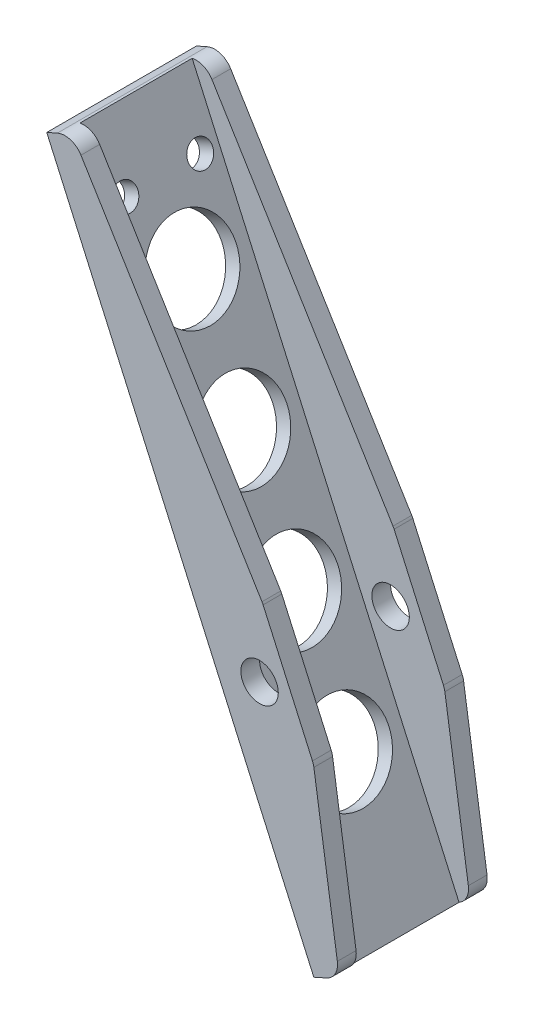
ISO-10303-21;
HEADER;
FILE_DESCRIPTION(('STEP AP214'),'2;1');
FILE_NAME('part.step','',(''),(''),'','','');
FILE_SCHEMA(('AUTOMOTIVE_DESIGN { 1 0 10303 214 1 1 1 1 }'));
ENDSEC;
DATA;
#1=APPLICATION_CONTEXT('core data for automotive mechanical design processes');
#2=APPLICATION_PROTOCOL_DEFINITION('international standard','automotive_design',2000,#1);
#3=PRODUCT_CONTEXT('',#1,'mechanical');
#4=PRODUCT('Part','Part','',(#3));
#5=PRODUCT_RELATED_PRODUCT_CATEGORY('part','',(#4));
#6=PRODUCT_DEFINITION_FORMATION('','',#4);
#7=PRODUCT_DEFINITION_CONTEXT('part definition',#1,'design');
#8=PRODUCT_DEFINITION('design','',#6,#7);
#9=PRODUCT_DEFINITION_SHAPE('','',#8);
#10=(LENGTH_UNIT() NAMED_UNIT(*) SI_UNIT(.MILLI.,.METRE.));
#11=(NAMED_UNIT(*) PLANE_ANGLE_UNIT() SI_UNIT($,.RADIAN.));
#12=(NAMED_UNIT(*) SI_UNIT($,.STERADIAN.) SOLID_ANGLE_UNIT());
#13=UNCERTAINTY_MEASURE_WITH_UNIT(LENGTH_MEASURE(1.E-05),#10,'distance_accuracy_value','');
#14=(GEOMETRIC_REPRESENTATION_CONTEXT(3) GLOBAL_UNCERTAINTY_ASSIGNED_CONTEXT((#13)) GLOBAL_UNIT_ASSIGNED_CONTEXT((#10,
#11,#12)) REPRESENTATION_CONTEXT('',''));
#15=CARTESIAN_POINT('',(0.,0.,0.));
#16=DIRECTION('',(0.,0.,1.));
#17=DIRECTION('',(1.,0.,0.));
#18=AXIS2_PLACEMENT_3D('',#15,#16,#17);
#19=CARTESIAN_POINT('',(19.652361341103,-1.01658363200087,-6.00000000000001));
#20=DIRECTION('',(0.407754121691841,-0.913091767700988,0.));
#21=DIRECTION('',(0.913091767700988,0.407754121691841,0.));
#22=AXIS2_PLACEMENT_3D('',#19,#20,#21);
#23=PLANE('',#22);
#24=DIRECTION('',(-0.913091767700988,-0.407754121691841,0.));
#25=VECTOR('',#24,1.);
#26=CARTESIAN_POINT('',(19.652361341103,-1.01658363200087,-27.));
#27=LINE('',#26,#25);
#28=CARTESIAN_POINT('',(10.7220892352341,-5.00452371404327,-27.));
#29=VERTEX_POINT('',#28);
#30=CARTESIAN_POINT('',(8.6952601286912,-5.90963309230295,-27.));
#31=VERTEX_POINT('',#30);
#32=EDGE_CURVE('E186',#29,#31,#27,.T.);
#33=ORIENTED_EDGE('',*,*,#32,.F.);
#34=DIRECTION('',(0.,0.,1.));
#35=VECTOR('',#34,1.);
#36=CARTESIAN_POINT('',(10.7220892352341,-5.00452371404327,-24.));
#37=LINE('',#36,#35);
#38=CARTESIAN_POINT('',(10.7220892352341,-5.00452371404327,-3.00000000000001));
#39=VERTEX_POINT('',#38);
#40=EDGE_CURVE('E11',#29,#39,#37,.T.);
#41=ORIENTED_EDGE('',*,*,#40,.T.);
#42=DIRECTION('',(0.913091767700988,0.407754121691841,0.));
#43=VECTOR('',#42,1.);
#44=CARTESIAN_POINT('',(19.652361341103,-1.01658363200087,-3.00000000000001));
#45=LINE('',#44,#43);
#46=CARTESIAN_POINT('',(8.6952601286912,-5.90963309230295,-3.00000000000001));
#47=VERTEX_POINT('',#46);
#48=EDGE_CURVE('E352',#47,#39,#45,.T.);
#49=ORIENTED_EDGE('',*,*,#48,.F.);
#50=DIRECTION('',(0.,0.,1.));
#51=VECTOR('',#50,1.);
#52=CARTESIAN_POINT('',(8.6952601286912,-5.90963309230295,-6.00000000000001));
#53=LINE('',#52,#51);
#54=EDGE_CURVE('E172',#31,#47,#53,.T.);
#55=ORIENTED_EDGE('',*,*,#54,.F.);
#56=EDGE_LOOP('',(#33,#41,#49,#55));
#57=FACE_BOUND('',#56,.T.);
#58=ADVANCED_FACE('F33',(#57),#23,.T.);
#59=CARTESIAN_POINT('',(8.6952601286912,-5.90963309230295,-6.00000000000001));
#60=DIRECTION('',(-0.913091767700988,-0.407754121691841,0.));
#61=DIRECTION('',(0.407754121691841,-0.913091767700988,0.));
#62=AXIS2_PLACEMENT_3D('',#59,#60,#61);
#63=PLANE('',#62);
#64=CARTESIAN_POINT('',(-0.584684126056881,14.8711273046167,-14.9999999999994));
#65=DIRECTION('',(-0.913091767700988,-0.407754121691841,0.));
#66=DIRECTION('',(0.407754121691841,-0.913091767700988,0.));
#67=AXIS2_PLACEMENT_3D('',#64,#65,#66);
#68=CIRCLE('',#67,7.04625207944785);
#69=CARTESIAN_POINT('',(2.28845420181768,8.43725253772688,-14.9999999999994));
#70=VERTEX_POINT('',#69);
#71=EDGE_CURVE('E291',#70,#70,#68,.T.);
#72=ORIENTED_EDGE('',*,*,#71,.F.);
#73=EDGE_LOOP('',(#72));
#74=FACE_BOUND('',#73,.T.);
#75=CARTESIAN_POINT('',(-8.7397665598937,33.1329626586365,-14.9999999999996));
#76=DIRECTION('',(-0.913091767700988,-0.407754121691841,0.));
#77=DIRECTION('',(0.407754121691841,-0.913091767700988,0.));
#78=AXIS2_PLACEMENT_3D('',#75,#76,#77);
#79=CIRCLE('',#78,7.04625207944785);
#80=CARTESIAN_POINT('',(-5.86662823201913,26.6990878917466,-14.9999999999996));
#81=VERTEX_POINT('',#80);
#82=EDGE_CURVE('E281',#81,#81,#79,.T.);
#83=ORIENTED_EDGE('',*,*,#82,.F.);
#84=EDGE_LOOP('',(#83));
#85=FACE_BOUND('',#84,.T.);
#86=CARTESIAN_POINT('',(-16.8948489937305,51.3947980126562,-14.9999999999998));
#87=DIRECTION('',(-0.913091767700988,-0.407754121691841,0.));
#88=DIRECTION('',(0.407754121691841,-0.913091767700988,0.));
#89=AXIS2_PLACEMENT_3D('',#86,#87,#88);
#90=CIRCLE('',#89,7.04625207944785);
#91=CARTESIAN_POINT('',(-14.0217106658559,44.9609232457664,-14.9999999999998));
#92=VERTEX_POINT('',#91);
#93=EDGE_CURVE('E278',#92,#92,#90,.T.);
#94=ORIENTED_EDGE('',*,*,#93,.F.);
#95=EDGE_LOOP('',(#94));
#96=FACE_BOUND('',#95,.T.);
#97=CARTESIAN_POINT('',(-25.0499314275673,69.656633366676,-15.));
#98=DIRECTION('',(-0.913091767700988,-0.407754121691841,0.));
#99=DIRECTION('',(0.407754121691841,-0.913091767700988,0.));
#100=AXIS2_PLACEMENT_3D('',#97,#98,#99);
#101=CIRCLE('',#100,7.04625207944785);
#102=CARTESIAN_POINT('',(-22.1767930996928,63.2227585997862,-15.));
#103=VERTEX_POINT('',#102);
#104=EDGE_CURVE('E275',#103,#103,#101,.T.);
#105=ORIENTED_EDGE('',*,*,#104,.F.);
#106=EDGE_LOOP('',(#105));
#107=FACE_BOUND('',#106,.T.);
#108=CARTESIAN_POINT('',(-29.8003299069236,80.2942934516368,-20.9999999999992));
#109=DIRECTION('',(-0.913091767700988,-0.407754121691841,0.));
#110=DIRECTION('',(0.407754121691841,-0.913091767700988,0.));
#111=AXIS2_PLACEMENT_3D('',#108,#109,#110);
#112=CIRCLE('',#111,2.);
#113=CARTESIAN_POINT('',(-28.98482166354,78.4681099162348,-20.9999999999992));
#114=VERTEX_POINT('',#113);
#115=EDGE_CURVE('E318',#114,#114,#112,.T.);
#116=ORIENTED_EDGE('',*,*,#115,.F.);
#117=EDGE_LOOP('',(#116));
#118=FACE_BOUND('',#117,.T.);
#119=CARTESIAN_POINT('',(-29.8003299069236,80.2942934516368,-8.99999999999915));
#120=DIRECTION('',(-0.913091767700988,-0.407754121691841,0.));
#121=DIRECTION('',(0.407754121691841,-0.913091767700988,0.));
#122=AXIS2_PLACEMENT_3D('',#119,#120,#121);
#123=CIRCLE('',#122,2.);
#124=CARTESIAN_POINT('',(-28.98482166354,78.4681099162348,-8.99999999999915));
#125=VERTEX_POINT('',#124);
#126=EDGE_CURVE('E322',#125,#125,#123,.T.);
#127=ORIENTED_EDGE('',*,*,#126,.F.);
#128=EDGE_LOOP('',(#127));
#129=FACE_BOUND('',#128,.T.);
#130=DIRECTION('',(0.407754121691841,-0.913091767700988,0.));
#131=VECTOR('',#130,1.);
#132=CARTESIAN_POINT('',(8.6952601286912,-5.90963309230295,-3.00000000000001));
#133=LINE('',#132,#131);
#134=CARTESIAN_POINT('',(-34.1189226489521,89.9650025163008,-3.00000000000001));
#135=VERTEX_POINT('',#134);
#136=EDGE_CURVE('E169',#135,#47,#133,.T.);
#137=ORIENTED_EDGE('',*,*,#136,.F.);
#138=DIRECTION('',(0.,0.,1.));
#139=VECTOR('',#138,1.);
#140=CARTESIAN_POINT('',(-34.1189226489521,89.9650025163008,-6.00000000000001));
#141=LINE('',#140,#139);
#142=CARTESIAN_POINT('',(-34.1189226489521,89.9650025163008,-27.));
#143=VERTEX_POINT('',#142);
#144=EDGE_CURVE('E163',#143,#135,#141,.T.);
#145=ORIENTED_EDGE('',*,*,#144,.F.);
#146=DIRECTION('',(-0.407754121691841,0.913091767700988,0.));
#147=VECTOR('',#146,1.);
#148=CARTESIAN_POINT('',(8.6952601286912,-5.90963309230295,-27.));
#149=LINE('',#148,#147);
#150=EDGE_CURVE('E167',#31,#143,#149,.T.);
#151=ORIENTED_EDGE('',*,*,#150,.F.);
#152=ORIENTED_EDGE('',*,*,#54,.T.);
#153=EDGE_LOOP('',(#137,#145,#151,#152));
#154=FACE_BOUND('',#153,.T.);
#155=ADVANCED_FACE('F165',(#74,#85,#96,#107,#118,#129,#154),#63,.T.);
#156=CARTESIAN_POINT('',(-34.1189226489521,89.9650025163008,-6.00000000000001));
#157=DIRECTION('',(-0.407754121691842,0.913091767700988,0.));
#158=DIRECTION('',(-0.913091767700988,-0.407754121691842,0.));
#159=AXIS2_PLACEMENT_3D('',#156,#157,#158);
#160=PLANE('',#159);
#161=DIRECTION('',(-0.913091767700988,-0.407754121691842,0.));
#162=VECTOR('',#161,1.);
#163=CARTESIAN_POINT('',(-34.1189226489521,89.9650025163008,-3.00000000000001));
#164=LINE('',#163,#162);
#165=CARTESIAN_POINT('',(-32.4178753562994,90.7246293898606,-3.00000000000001));
#166=VERTEX_POINT('',#165);
#167=EDGE_CURVE('E347',#166,#135,#164,.T.);
#168=ORIENTED_EDGE('',*,*,#167,.F.);
#169=DIRECTION('',(0.,0.,1.));
#170=VECTOR('',#169,1.);
#171=CARTESIAN_POINT('',(-32.4178753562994,90.7246293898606,-27.));
#172=LINE('',#171,#170);
#173=CARTESIAN_POINT('',(-32.4178753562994,90.7246293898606,-27.));
#174=VERTEX_POINT('',#173);
#175=EDGE_CURVE('E179',#166,#174,#172,.F.);
#176=ORIENTED_EDGE('',*,*,#175,.T.);
#177=DIRECTION('',(0.913091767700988,0.407754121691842,0.));
#178=VECTOR('',#177,1.);
#179=CARTESIAN_POINT('',(-34.1189226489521,89.9650025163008,-27.));
#180=LINE('',#179,#178);
#181=EDGE_CURVE('E176',#143,#174,#180,.T.);
#182=ORIENTED_EDGE('',*,*,#181,.F.);
#183=ORIENTED_EDGE('',*,*,#144,.T.);
#184=EDGE_LOOP('',(#168,#176,#182,#183));
#185=FACE_BOUND('',#184,.T.);
#186=ADVANCED_FACE('F177',(#185),#160,.T.);
#187=CARTESIAN_POINT('',(-23.1618214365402,94.8580519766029,-6.00000000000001));
#188=DIRECTION('',(0.913091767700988,0.407754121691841,0.));
#189=DIRECTION('',(-0.407754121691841,0.913091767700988,0.));
#190=AXIS2_PLACEMENT_3D('',#187,#188,#189);
#191=PLANE('',#190);
#192=DIRECTION('',(-0.407754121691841,0.913091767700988,0.));
#193=VECTOR('',#192,1.);
#194=CARTESIAN_POINT('',(-23.1618214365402,94.8580519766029,-6.00000000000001));
#195=LINE('',#194,#193);
#196=CARTESIAN_POINT('',(8.47625919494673,24.0102801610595,-6.00000000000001));
#197=VERTEX_POINT('',#196);
#198=CARTESIAN_POINT('',(0.566679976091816,41.7223553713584,-6.00000000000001));
#199=VERTEX_POINT('',#198);
#200=EDGE_CURVE('E173',#197,#199,#195,.T.);
#201=ORIENTED_EDGE('',*,*,#200,.T.);
#202=DIRECTION('',(0.,0.,1.));
#203=VECTOR('',#202,1.);
#204=CARTESIAN_POINT('',(0.566679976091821,41.7223553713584,-3.00000000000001));
#205=LINE('',#204,#203);
#206=CARTESIAN_POINT('',(0.566679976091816,41.7223553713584,-3.00000000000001));
#207=VERTEX_POINT('',#206);
#208=EDGE_CURVE('E255',#199,#207,#205,.T.);
#209=ORIENTED_EDGE('',*,*,#208,.T.);
#210=DIRECTION('',(-0.407754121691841,0.913091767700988,0.));
#211=VECTOR('',#210,1.);
#212=CARTESIAN_POINT('',(-23.1618214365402,94.8580519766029,-3.00000000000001));
#213=LINE('',#212,#211);
#214=CARTESIAN_POINT('',(8.47625919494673,24.0102801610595,-3.00000000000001));
#215=VERTEX_POINT('',#214);
#216=EDGE_CURVE('E349',#215,#207,#213,.T.);
#217=ORIENTED_EDGE('',*,*,#216,.F.);
#218=DIRECTION('',(0.,0.,1.));
#219=VECTOR('',#218,1.);
#220=CARTESIAN_POINT('',(8.47625919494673,24.0102801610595,-6.00000000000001));
#221=LINE('',#220,#219);
#222=EDGE_CURVE('E253',#215,#197,#221,.F.);
#223=ORIENTED_EDGE('',*,*,#222,.T.);
#224=EDGE_LOOP('',(#201,#209,#217,#223));
#225=FACE_BOUND('',#224,.T.);
#226=ADVANCED_FACE('F421',(#225),#191,.T.);
#227=CARTESIAN_POINT('',(0.,0.,-6.00000000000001));
#228=DIRECTION('',(0.,0.,-1.));
#229=DIRECTION('',(-1.,0.,0.));
#230=AXIS2_PLACEMENT_3D('',#227,#228,#229);
#231=PLANE('',#230);
#232=DIRECTION('',(0.407754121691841,-0.913091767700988,0.));
#233=VECTOR('',#232,1.);
#234=CARTESIAN_POINT('',(10.9779895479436,-4.89024778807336,-6.00000000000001));
#235=LINE('',#234,#233);
#236=CARTESIAN_POINT('',(-31.8082953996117,90.9219156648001,-6.00000000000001));
#237=VERTEX_POINT('',#236);
#238=CARTESIAN_POINT('',(10.9726400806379,-4.87826862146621,-6.00000000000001));
#239=VERTEX_POINT('',#238);
#240=EDGE_CURVE('E197',#237,#239,#235,.T.);
#241=ORIENTED_EDGE('',*,*,#240,.F.);
#242=CARTESIAN_POINT('',(-31.1946129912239,87.9853540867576,-6.00000000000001));
#243=DIRECTION('',(0.,0.,-1.));
#244=DIRECTION('',(-1.,0.,0.));
#245=AXIS2_PLACEMENT_3D('',#242,#243,#244);
#246=CIRCLE('',#245,3.);
#247=CARTESIAN_POINT('',(-28.6348307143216,89.5498075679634,-6.00000000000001));
#248=VERTEX_POINT('',#247);
#249=EDGE_CURVE('E231',#237,#248,#246,.T.);
#250=ORIENTED_EDGE('',*,*,#249,.T.);
#251=DIRECTION('',(-0.52148449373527,0.853260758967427,0.));
#252=VECTOR('',#251,1.);
#253=CARTESIAN_POINT('',(18.9985834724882,11.6113000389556,-6.00000000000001));
#254=LINE('',#253,#252);
#255=CARTESIAN_POINT('',(0.387186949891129,42.0635464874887,-6.00000000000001));
#256=VERTEX_POINT('',#255);
#257=EDGE_CURVE('E315',#256,#248,#254,.T.);
#258=ORIENTED_EDGE('',*,*,#257,.F.);
#259=CARTESIAN_POINT('',(-2.17259532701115,40.4990930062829,-6.00000000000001));
#260=DIRECTION('',(0.,0.,-1.));
#261=DIRECTION('',(-1.,0.,0.));
#262=AXIS2_PLACEMENT_3D('',#259,#260,#261);
#263=CIRCLE('',#262,3.);
#264=EDGE_CURVE('E229',#256,#199,#263,.T.);
#265=ORIENTED_EDGE('',*,*,#264,.T.);
#266=ORIENTED_EDGE('',*,*,#200,.F.);
#267=CARTESIAN_POINT('',(5.73698389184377,22.787017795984,-6.00000000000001));
#268=DIRECTION('',(0.,0.,-1.));
#269=DIRECTION('',(-1.,0.,0.));
#270=AXIS2_PLACEMENT_3D('',#267,#268,#269);
#271=CIRCLE('',#270,3.);
#272=CARTESIAN_POINT('',(8.70372337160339,23.2325027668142,-6.00000000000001));
#273=VERTEX_POINT('',#272);
#274=EDGE_CURVE('E227',#197,#273,#271,.T.);
#275=ORIENTED_EDGE('',*,*,#274,.T.);
#276=DIRECTION('',(-0.148494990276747,0.988913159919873,0.));
#277=VECTOR('',#276,1.);
#278=CARTESIAN_POINT('',(11.9234613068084,1.79042442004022,-6.00000000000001));
#279=LINE('',#278,#277);
#280=CARTESIAN_POINT('',(12.4655663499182,-1.81976344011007,-6.00000000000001));
#281=VERTEX_POINT('',#280);
#282=EDGE_CURVE('E304',#281,#273,#279,.T.);
#283=ORIENTED_EDGE('',*,*,#282,.F.);
#284=CARTESIAN_POINT('',(9.4988268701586,-2.26524841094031,-6.00000000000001));
#285=DIRECTION('',(0.,0.,-1.));
#286=DIRECTION('',(-1.,0.,0.));
#287=AXIS2_PLACEMENT_3D('',#284,#285,#286);
#288=CIRCLE('',#287,3.);
#289=EDGE_CURVE('E225',#281,#239,#288,.T.);
#290=ORIENTED_EDGE('',*,*,#289,.T.);
#291=EDGE_LOOP('',(#241,#250,#258,#265,#266,#275,#283,#290));
#292=FACE_BOUND('',#291,.T.);
#293=CARTESIAN_POINT('',(0.,30.7290411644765,-6.00000000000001));
#294=DIRECTION('',(0.,0.,1.));
#295=DIRECTION('',(1.,0.,0.));
#296=AXIS2_PLACEMENT_3D('',#293,#294,#295);
#297=CIRCLE('',#296,3.);
#298=CARTESIAN_POINT('',(3.,30.7290411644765,-6.00000000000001));
#299=VERTEX_POINT('',#298);
#300=EDGE_CURVE('E355',#299,#299,#297,.T.);
#301=ORIENTED_EDGE('',*,*,#300,.T.);
#302=EDGE_LOOP('',(#301));
#303=FACE_BOUND('',#302,.T.);
#304=ADVANCED_FACE('F362',(#292,#303),#231,.T.);
#305=CARTESIAN_POINT('',(0.,0.,-3.00000000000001));
#306=DIRECTION('',(0.,0.,-1.));
#307=DIRECTION('',(-1.,0.,0.));
#308=AXIS2_PLACEMENT_3D('',#305,#306,#307);
#309=PLANE('',#308);
#310=CARTESIAN_POINT('',(0.,30.7290411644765,-3.00000000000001));
#311=DIRECTION('',(0.,0.,1.));
#312=DIRECTION('',(1.,0.,0.));
#313=AXIS2_PLACEMENT_3D('',#310,#311,#312);
#314=CIRCLE('',#313,3.);
#315=CARTESIAN_POINT('',(3.,30.7290411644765,-3.00000000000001));
#316=VERTEX_POINT('',#315);
#317=EDGE_CURVE('E208',#316,#316,#314,.T.);
#318=ORIENTED_EDGE('',*,*,#317,.F.);
#319=EDGE_LOOP('',(#318));
#320=FACE_BOUND('',#319,.T.);
#321=DIRECTION('',(0.52148449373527,-0.853260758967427,0.));
#322=VECTOR('',#321,1.);
#323=CARTESIAN_POINT('',(0.48791762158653,41.8987294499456,-3.00000000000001));
#324=LINE('',#323,#322);
#325=CARTESIAN_POINT('',(-28.6348307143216,89.5498075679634,-3.00000000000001));
#326=VERTEX_POINT('',#325);
#327=CARTESIAN_POINT('',(0.387186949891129,42.0635464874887,-3.00000000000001));
#328=VERTEX_POINT('',#327);
#329=EDGE_CURVE('E307',#326,#328,#324,.T.);
#330=ORIENTED_EDGE('',*,*,#329,.F.);
#331=CARTESIAN_POINT('',(-31.1946129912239,87.9853540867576,-3.00000000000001));
#332=DIRECTION('',(0.,0.,-1.));
#333=DIRECTION('',(-1.,0.,0.));
#334=AXIS2_PLACEMENT_3D('',#331,#332,#333);
#335=CIRCLE('',#334,3.);
#336=EDGE_CURVE('E243',#326,#166,#335,.F.);
#337=ORIENTED_EDGE('',*,*,#336,.T.);
#338=ORIENTED_EDGE('',*,*,#167,.T.);
#339=ORIENTED_EDGE('',*,*,#136,.T.);
#340=ORIENTED_EDGE('',*,*,#48,.T.);
#341=CARTESIAN_POINT('',(9.4988268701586,-2.26524841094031,-3.00000000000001));
#342=DIRECTION('',(0.,0.,-1.));
#343=DIRECTION('',(-1.,0.,0.));
#344=AXIS2_PLACEMENT_3D('',#341,#342,#343);
#345=CIRCLE('',#344,3.);
#346=CARTESIAN_POINT('',(12.4655663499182,-1.81976344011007,-3.00000000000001));
#347=VERTEX_POINT('',#346);
#348=EDGE_CURVE('E237',#39,#347,#345,.F.);
#349=ORIENTED_EDGE('',*,*,#348,.T.);
#350=DIRECTION('',(0.148494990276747,-0.988913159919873,0.));
#351=VECTOR('',#350,1.);
#352=CARTESIAN_POINT('',(8.64300005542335,23.6368940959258,-3.00000000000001));
#353=LINE('',#352,#351);
#354=CARTESIAN_POINT('',(8.70372337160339,23.2325027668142,-3.00000000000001));
#355=VERTEX_POINT('',#354);
#356=EDGE_CURVE('E274',#355,#347,#353,.T.);
#357=ORIENTED_EDGE('',*,*,#356,.F.);
#358=CARTESIAN_POINT('',(5.73698389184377,22.787017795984,-3.00000000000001));
#359=DIRECTION('',(0.,0.,-1.));
#360=DIRECTION('',(-1.,0.,0.));
#361=AXIS2_PLACEMENT_3D('',#358,#359,#360);
#362=CIRCLE('',#361,3.);
#363=EDGE_CURVE('E239',#355,#215,#362,.F.);
#364=ORIENTED_EDGE('',*,*,#363,.T.);
#365=ORIENTED_EDGE('',*,*,#216,.T.);
#366=CARTESIAN_POINT('',(-2.17259532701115,40.4990930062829,-3.00000000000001));
#367=DIRECTION('',(0.,0.,-1.));
#368=DIRECTION('',(-1.,0.,0.));
#369=AXIS2_PLACEMENT_3D('',#366,#367,#368);
#370=CIRCLE('',#369,3.);
#371=EDGE_CURVE('E241',#207,#328,#370,.F.);
#372=ORIENTED_EDGE('',*,*,#371,.T.);
#373=EDGE_LOOP('',(#330,#337,#338,#339,#340,#349,#357,#364,#365,#372));
#374=FACE_BOUND('',#373,.T.);
#375=ADVANCED_FACE('F368',(#320,#374),#309,.F.);
#376=CARTESIAN_POINT('',(0.,30.7290411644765,-6.00000000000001));
#377=DIRECTION('',(0.,0.,1.));
#378=DIRECTION('',(1.,0.,0.));
#379=AXIS2_PLACEMENT_3D('',#376,#377,#378);
#380=CYLINDRICAL_SURFACE('',#379,3.);
#381=ORIENTED_EDGE('',*,*,#300,.F.);
#382=EDGE_LOOP('',(#381));
#383=FACE_BOUND('',#382,.T.);
#384=ORIENTED_EDGE('',*,*,#317,.T.);
#385=EDGE_LOOP('',(#384));
#386=FACE_BOUND('',#385,.T.);
#387=ADVANCED_FACE('F364',(#383,#386),#380,.F.);
#388=CARTESIAN_POINT('',(10.9779895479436,-4.89024778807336,-24.));
#389=DIRECTION('',(-0.913091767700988,-0.407754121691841,0.));
#390=DIRECTION('',(0.407754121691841,-0.913091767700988,0.));
#391=AXIS2_PLACEMENT_3D('',#388,#389,#390);
#392=PLANE('',#391);
#393=CARTESIAN_POINT('',(1.69804529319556,15.8905126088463,-14.9999999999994));
#394=DIRECTION('',(-0.913091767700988,-0.407754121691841,0.));
#395=DIRECTION('',(0.407754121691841,-0.913091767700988,0.));
#396=AXIS2_PLACEMENT_3D('',#393,#394,#395);
#397=CIRCLE('',#396,7.04625207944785);
#398=CARTESIAN_POINT('',(4.57118362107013,9.45663784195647,-14.9999999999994));
#399=VERTEX_POINT('',#398);
#400=EDGE_CURVE('E37',#399,#399,#397,.T.);
#401=ORIENTED_EDGE('',*,*,#400,.T.);
#402=EDGE_LOOP('',(#401));
#403=FACE_BOUND('',#402,.T.);
#404=CARTESIAN_POINT('',(-6.45703714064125,34.1523479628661,-14.9999999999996));
#405=DIRECTION('',(-0.913091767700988,-0.407754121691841,0.));
#406=DIRECTION('',(0.407754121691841,-0.913091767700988,0.));
#407=AXIS2_PLACEMENT_3D('',#404,#405,#406);
#408=CIRCLE('',#407,7.04625207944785);
#409=CARTESIAN_POINT('',(-3.58389881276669,27.7184731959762,-14.9999999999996));
#410=VERTEX_POINT('',#409);
#411=EDGE_CURVE('E279',#410,#410,#408,.T.);
#412=ORIENTED_EDGE('',*,*,#411,.T.);
#413=EDGE_LOOP('',(#412));
#414=FACE_BOUND('',#413,.T.);
#415=CARTESIAN_POINT('',(-14.6121195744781,52.4141833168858,-14.9999999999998));
#416=DIRECTION('',(-0.913091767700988,-0.407754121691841,0.));
#417=DIRECTION('',(0.407754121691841,-0.913091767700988,0.));
#418=AXIS2_PLACEMENT_3D('',#415,#416,#417);
#419=CIRCLE('',#418,7.04625207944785);
#420=CARTESIAN_POINT('',(-11.7389812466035,45.980308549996,-14.9999999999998));
#421=VERTEX_POINT('',#420);
#422=EDGE_CURVE('E276',#421,#421,#419,.T.);
#423=ORIENTED_EDGE('',*,*,#422,.T.);
#424=EDGE_LOOP('',(#423));
#425=FACE_BOUND('',#424,.T.);
#426=CARTESIAN_POINT('',(-22.7672020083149,70.6760186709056,-15.));
#427=DIRECTION('',(-0.913091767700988,-0.407754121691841,0.));
#428=DIRECTION('',(0.407754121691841,-0.913091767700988,0.));
#429=AXIS2_PLACEMENT_3D('',#426,#427,#428);
#430=CIRCLE('',#429,7.04625207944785);
#431=CARTESIAN_POINT('',(-19.8940636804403,64.2421439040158,-15.));
#432=VERTEX_POINT('',#431);
#433=EDGE_CURVE('E271',#432,#432,#430,.T.);
#434=ORIENTED_EDGE('',*,*,#433,.T.);
#435=EDGE_LOOP('',(#434));
#436=FACE_BOUND('',#435,.T.);
#437=CARTESIAN_POINT('',(-27.5176004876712,81.3136787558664,-20.9999999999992));
#438=DIRECTION('',(-0.913091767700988,-0.407754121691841,0.));
#439=DIRECTION('',(0.407754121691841,-0.913091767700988,0.));
#440=AXIS2_PLACEMENT_3D('',#437,#438,#439);
#441=CIRCLE('',#440,2.);
#442=CARTESIAN_POINT('',(-26.7020922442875,79.4874952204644,-20.9999999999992));
#443=VERTEX_POINT('',#442);
#444=EDGE_CURVE('E321',#443,#443,#441,.T.);
#445=ORIENTED_EDGE('',*,*,#444,.T.);
#446=EDGE_LOOP('',(#445));
#447=FACE_BOUND('',#446,.T.);
#448=CARTESIAN_POINT('',(-27.5176004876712,81.3136787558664,-8.99999999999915));
#449=DIRECTION('',(-0.913091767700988,-0.407754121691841,0.));
#450=DIRECTION('',(0.407754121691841,-0.913091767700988,0.));
#451=AXIS2_PLACEMENT_3D('',#448,#449,#450);
#452=CIRCLE('',#451,2.);
#453=CARTESIAN_POINT('',(-26.7020922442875,79.4874952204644,-8.99999999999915));
#454=VERTEX_POINT('',#453);
#455=EDGE_CURVE('E324',#454,#454,#452,.T.);
#456=ORIENTED_EDGE('',*,*,#455,.T.);
#457=EDGE_LOOP('',(#456));
#458=FACE_BOUND('',#457,.T.);
#459=DIRECTION('',(0.407754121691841,-0.913091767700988,0.));
#460=VECTOR('',#459,1.);
#461=CARTESIAN_POINT('',(10.9779895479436,-4.89024778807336,-24.));
#462=LINE('',#461,#460);
#463=CARTESIAN_POINT('',(-31.8082953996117,90.9219156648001,-24.));
#464=VERTEX_POINT('',#463);
#465=CARTESIAN_POINT('',(10.9726400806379,-4.87826862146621,-24.));
#466=VERTEX_POINT('',#465);
#467=EDGE_CURVE('E204',#464,#466,#462,.T.);
#468=ORIENTED_EDGE('',*,*,#467,.F.);
#469=DIRECTION('',(0.,0.,-1.));
#470=VECTOR('',#469,1.);
#471=CARTESIAN_POINT('',(-31.8082953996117,90.9219156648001,-24.));
#472=LINE('',#471,#470);
#473=EDGE_CURVE('E223',#464,#237,#472,.F.);
#474=ORIENTED_EDGE('',*,*,#473,.T.);
#475=ORIENTED_EDGE('',*,*,#240,.T.);
#476=DIRECTION('',(0.,0.,-1.));
#477=VECTOR('',#476,1.);
#478=CARTESIAN_POINT('',(10.9726400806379,-4.87826862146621,-6.00000000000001));
#479=LINE('',#478,#477);
#480=EDGE_CURVE('E219',#239,#466,#479,.T.);
#481=ORIENTED_EDGE('',*,*,#480,.T.);
#482=EDGE_LOOP('',(#468,#474,#475,#481));
#483=FACE_BOUND('',#482,.T.);
#484=ADVANCED_FACE('F367',(#403,#414,#425,#436,#447,#458,#483),#392,.F.);
#485=CARTESIAN_POINT('',(0.,0.,-24.));
#486=DIRECTION('',(0.,0.,-1.));
#487=DIRECTION('',(-1.,0.,0.));
#488=AXIS2_PLACEMENT_3D('',#485,#486,#487);
#489=PLANE('',#488);
#490=CARTESIAN_POINT('',(0.,30.7290411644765,-24.));
#491=DIRECTION('',(0.,0.,-1.));
#492=DIRECTION('',(-1.,0.,0.));
#493=AXIS2_PLACEMENT_3D('',#490,#491,#492);
#494=CIRCLE('',#493,3.);
#495=CARTESIAN_POINT('',(-3.,30.7290411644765,-24.));
#496=VERTEX_POINT('',#495);
#497=EDGE_CURVE('E193',#496,#496,#494,.T.);
#498=ORIENTED_EDGE('',*,*,#497,.T.);
#499=EDGE_LOOP('',(#498));
#500=FACE_BOUND('',#499,.T.);
#501=DIRECTION('',(-0.52148449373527,0.853260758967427,0.));
#502=VECTOR('',#501,1.);
#503=CARTESIAN_POINT('',(18.9985834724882,11.6113000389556,-24.));
#504=LINE('',#503,#502);
#505=CARTESIAN_POINT('',(0.387186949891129,42.0635464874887,-24.));
#506=VERTEX_POINT('',#505);
#507=CARTESIAN_POINT('',(-28.6348307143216,89.5498075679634,-24.));
#508=VERTEX_POINT('',#507);
#509=EDGE_CURVE('E310',#506,#508,#504,.T.);
#510=ORIENTED_EDGE('',*,*,#509,.T.);
#511=CARTESIAN_POINT('',(-31.1946129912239,87.9853540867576,-24.));
#512=DIRECTION('',(0.,0.,-1.));
#513=DIRECTION('',(-1.,0.,0.));
#514=AXIS2_PLACEMENT_3D('',#511,#512,#513);
#515=CIRCLE('',#514,3.);
#516=EDGE_CURVE('E217',#508,#464,#515,.F.);
#517=ORIENTED_EDGE('',*,*,#516,.T.);
#518=ORIENTED_EDGE('',*,*,#467,.T.);
#519=CARTESIAN_POINT('',(9.4988268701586,-2.26524841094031,-24.));
#520=DIRECTION('',(0.,0.,-1.));
#521=DIRECTION('',(-1.,0.,0.));
#522=AXIS2_PLACEMENT_3D('',#519,#520,#521);
#523=CIRCLE('',#522,3.);
#524=CARTESIAN_POINT('',(12.4655663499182,-1.81976344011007,-24.));
#525=VERTEX_POINT('',#524);
#526=EDGE_CURVE('E211',#466,#525,#523,.F.);
#527=ORIENTED_EDGE('',*,*,#526,.T.);
#528=DIRECTION('',(-0.148494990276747,0.988913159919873,0.));
#529=VECTOR('',#528,1.);
#530=CARTESIAN_POINT('',(11.9234613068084,1.79042442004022,-24.));
#531=LINE('',#530,#529);
#532=CARTESIAN_POINT('',(8.70372337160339,23.2325027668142,-24.));
#533=VERTEX_POINT('',#532);
#534=EDGE_CURVE('E299',#525,#533,#531,.T.);
#535=ORIENTED_EDGE('',*,*,#534,.T.);
#536=CARTESIAN_POINT('',(5.73698389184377,22.787017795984,-24.));
#537=DIRECTION('',(0.,0.,-1.));
#538=DIRECTION('',(-1.,0.,0.));
#539=AXIS2_PLACEMENT_3D('',#536,#537,#538);
#540=CIRCLE('',#539,3.);
#541=CARTESIAN_POINT('',(8.47625919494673,24.0102801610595,-24.));
#542=VERTEX_POINT('',#541);
#543=EDGE_CURVE('E213',#533,#542,#540,.F.);
#544=ORIENTED_EDGE('',*,*,#543,.T.);
#545=DIRECTION('',(0.407754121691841,-0.913091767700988,0.));
#546=VECTOR('',#545,1.);
#547=CARTESIAN_POINT('',(-23.1618214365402,94.8580519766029,-24.));
#548=LINE('',#547,#546);
#549=CARTESIAN_POINT('',(0.566679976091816,41.7223553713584,-24.));
#550=VERTEX_POINT('',#549);
#551=EDGE_CURVE('E188',#550,#542,#548,.T.);
#552=ORIENTED_EDGE('',*,*,#551,.F.);
#553=CARTESIAN_POINT('',(-2.17259532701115,40.4990930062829,-24.));
#554=DIRECTION('',(0.,0.,-1.));
#555=DIRECTION('',(-1.,0.,0.));
#556=AXIS2_PLACEMENT_3D('',#553,#554,#555);
#557=CIRCLE('',#556,3.);
#558=EDGE_CURVE('E215',#550,#506,#557,.F.);
#559=ORIENTED_EDGE('',*,*,#558,.T.);
#560=EDGE_LOOP('',(#510,#517,#518,#527,#535,#544,#552,#559));
#561=FACE_BOUND('',#560,.T.);
#562=ADVANCED_FACE('F386',(#500,#561),#489,.F.);
#563=CARTESIAN_POINT('',(0.,0.,-27.));
#564=DIRECTION('',(0.,0.,-1.));
#565=DIRECTION('',(-1.,0.,0.));
#566=AXIS2_PLACEMENT_3D('',#563,#564,#565);
#567=PLANE('',#566);
#568=ORIENTED_EDGE('',*,*,#181,.T.);
#569=CARTESIAN_POINT('',(-31.1946129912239,87.9853540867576,-27.));
#570=DIRECTION('',(0.,0.,-1.));
#571=DIRECTION('',(-1.,0.,0.));
#572=AXIS2_PLACEMENT_3D('',#569,#570,#571);
#573=CIRCLE('',#572,3.);
#574=CARTESIAN_POINT('',(-28.6348307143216,89.5498075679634,-27.));
#575=VERTEX_POINT('',#574);
#576=EDGE_CURVE('E251',#174,#575,#573,.T.);
#577=ORIENTED_EDGE('',*,*,#576,.T.);
#578=DIRECTION('',(0.52148449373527,-0.853260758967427,0.));
#579=VECTOR('',#578,1.);
#580=CARTESIAN_POINT('',(0.48791762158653,41.8987294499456,-27.));
#581=LINE('',#580,#579);
#582=CARTESIAN_POINT('',(0.387186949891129,42.0635464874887,-27.));
#583=VERTEX_POINT('',#582);
#584=EDGE_CURVE('E308',#575,#583,#581,.T.);
#585=ORIENTED_EDGE('',*,*,#584,.T.);
#586=CARTESIAN_POINT('',(-2.17259532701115,40.4990930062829,-27.));
#587=DIRECTION('',(0.,0.,-1.));
#588=DIRECTION('',(-1.,0.,0.));
#589=AXIS2_PLACEMENT_3D('',#586,#587,#588);
#590=CIRCLE('',#589,3.);
#591=CARTESIAN_POINT('',(0.566679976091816,41.7223553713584,-27.));
#592=VERTEX_POINT('',#591);
#593=EDGE_CURVE('E57',#583,#592,#590,.T.);
#594=ORIENTED_EDGE('',*,*,#593,.T.);
#595=DIRECTION('',(0.407754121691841,-0.913091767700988,0.));
#596=VECTOR('',#595,1.);
#597=CARTESIAN_POINT('',(-23.1618214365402,94.8580519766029,-27.));
#598=LINE('',#597,#596);
#599=CARTESIAN_POINT('',(8.47625919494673,24.0102801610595,-27.));
#600=VERTEX_POINT('',#599);
#601=EDGE_CURVE('E181',#592,#600,#598,.T.);
#602=ORIENTED_EDGE('',*,*,#601,.T.);
#603=CARTESIAN_POINT('',(5.73698389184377,22.787017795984,-27.));
#604=DIRECTION('',(0.,0.,-1.));
#605=DIRECTION('',(-1.,0.,0.));
#606=AXIS2_PLACEMENT_3D('',#603,#604,#605);
#607=CIRCLE('',#606,3.);
#608=CARTESIAN_POINT('',(8.70372337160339,23.2325027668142,-27.));
#609=VERTEX_POINT('',#608);
#610=EDGE_CURVE('E248',#600,#609,#607,.T.);
#611=ORIENTED_EDGE('',*,*,#610,.T.);
#612=DIRECTION('',(0.148494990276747,-0.988913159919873,0.));
#613=VECTOR('',#612,1.);
#614=CARTESIAN_POINT('',(8.64300005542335,23.6368940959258,-27.));
#615=LINE('',#614,#613);
#616=CARTESIAN_POINT('',(12.4655663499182,-1.81976344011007,-27.));
#617=VERTEX_POINT('',#616);
#618=EDGE_CURVE('E296',#609,#617,#615,.T.);
#619=ORIENTED_EDGE('',*,*,#618,.T.);
#620=CARTESIAN_POINT('',(9.4988268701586,-2.26524841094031,-27.));
#621=DIRECTION('',(0.,0.,-1.));
#622=DIRECTION('',(-1.,0.,0.));
#623=AXIS2_PLACEMENT_3D('',#620,#621,#622);
#624=CIRCLE('',#623,3.);
#625=EDGE_CURVE('E246',#617,#29,#624,.T.);
#626=ORIENTED_EDGE('',*,*,#625,.T.);
#627=ORIENTED_EDGE('',*,*,#32,.T.);
#628=ORIENTED_EDGE('',*,*,#150,.T.);
#629=EDGE_LOOP('',(#568,#577,#585,#594,#602,#611,#619,#626,#627,#628));
#630=FACE_BOUND('',#629,.T.);
#631=CARTESIAN_POINT('',(0.,30.7290411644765,-27.));
#632=DIRECTION('',(0.,0.,-1.));
#633=DIRECTION('',(-1.,0.,0.));
#634=AXIS2_PLACEMENT_3D('',#631,#632,#633);
#635=CIRCLE('',#634,3.);
#636=CARTESIAN_POINT('',(-3.,30.7290411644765,-27.));
#637=VERTEX_POINT('',#636);
#638=EDGE_CURVE('E190',#637,#637,#635,.T.);
#639=ORIENTED_EDGE('',*,*,#638,.F.);
#640=EDGE_LOOP('',(#639));
#641=FACE_BOUND('',#640,.T.);
#642=ADVANCED_FACE('F183',(#630,#641),#567,.T.);
#643=CARTESIAN_POINT('',(-23.1618214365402,94.8580519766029,-27.));
#644=DIRECTION('',(-0.913091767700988,-0.407754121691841,0.));
#645=DIRECTION('',(0.407754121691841,-0.913091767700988,0.));
#646=AXIS2_PLACEMENT_3D('',#643,#644,#645);
#647=PLANE('',#646);
#648=ORIENTED_EDGE('',*,*,#601,.F.);
#649=DIRECTION('',(0.,0.,1.));
#650=VECTOR('',#649,1.);
#651=CARTESIAN_POINT('',(0.566679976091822,41.7223553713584,-27.));
#652=LINE('',#651,#650);
#653=EDGE_CURVE('E259',#592,#550,#652,.T.);
#654=ORIENTED_EDGE('',*,*,#653,.T.);
#655=ORIENTED_EDGE('',*,*,#551,.T.);
#656=DIRECTION('',(0.,0.,1.));
#657=VECTOR('',#656,1.);
#658=CARTESIAN_POINT('',(8.47625919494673,24.0102801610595,-27.));
#659=LINE('',#658,#657);
#660=EDGE_CURVE('E50',#542,#600,#659,.F.);
#661=ORIENTED_EDGE('',*,*,#660,.T.);
#662=EDGE_LOOP('',(#648,#654,#655,#661));
#663=FACE_BOUND('',#662,.T.);
#664=ADVANCED_FACE('F392',(#663),#647,.F.);
#665=CARTESIAN_POINT('',(0.,30.7290411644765,-27.));
#666=DIRECTION('',(0.,0.,1.));
#667=DIRECTION('',(1.,0.,0.));
#668=AXIS2_PLACEMENT_3D('',#665,#666,#667);
#669=CYLINDRICAL_SURFACE('',#668,3.);
#670=ORIENTED_EDGE('',*,*,#638,.T.);
#671=EDGE_LOOP('',(#670));
#672=FACE_BOUND('',#671,.T.);
#673=ORIENTED_EDGE('',*,*,#497,.F.);
#674=EDGE_LOOP('',(#673));
#675=FACE_BOUND('',#674,.T.);
#676=ADVANCED_FACE('F491',(#672,#675),#669,.F.);
#677=CARTESIAN_POINT('',(-26.1479628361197,81.9253099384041,-8.99999999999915));
#678=DIRECTION('',(-0.913091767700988,-0.407754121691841,0.));
#679=DIRECTION('',(0.407754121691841,-0.913091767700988,0.));
#680=AXIS2_PLACEMENT_3D('',#677,#678,#679);
#681=CYLINDRICAL_SURFACE('',#680,2.);
#682=CARTESIAN_POINT('',(-28.98482166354,78.4681099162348,-8.99999999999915));
#683=CARTESIAN_POINT('',(-28.9610432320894,78.4787285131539,-8.99999999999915));
#684=CARTESIAN_POINT('',(-28.9372648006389,78.4893471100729,-8.99999999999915));
#685=CARTESIAN_POINT('',(-28.8897079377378,78.510584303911,-8.99999999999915));
#686=CARTESIAN_POINT('',(-28.8659295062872,78.5212029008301,-8.99999999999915));
#687=CARTESIAN_POINT('',(-28.8183726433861,78.5424400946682,-8.99999999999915));
#688=CARTESIAN_POINT('',(-28.7945942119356,78.5530586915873,-8.99999999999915));
#689=CARTESIAN_POINT('',(-28.7470373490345,78.5742958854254,-8.99999999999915));
#690=CARTESIAN_POINT('',(-28.723258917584,78.5849144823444,-8.99999999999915));
#691=CARTESIAN_POINT('',(-28.6757020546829,78.6061516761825,-8.99999999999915));
#692=CARTESIAN_POINT('',(-28.6519236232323,78.6167702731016,-8.99999999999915));
#693=CARTESIAN_POINT('',(-28.6043667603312,78.6380074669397,-8.99999999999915));
#694=CARTESIAN_POINT('',(-28.5805883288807,78.6486260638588,-8.99999999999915));
#695=CARTESIAN_POINT('',(-28.5330314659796,78.6698632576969,-8.99999999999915));
#696=CARTESIAN_POINT('',(-28.509253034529,78.680481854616,-8.99999999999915));
#697=CARTESIAN_POINT('',(-28.4616961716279,78.7017190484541,-8.99999999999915));
#698=CARTESIAN_POINT('',(-28.4379177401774,78.7123376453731,-8.99999999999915));
#699=CARTESIAN_POINT('',(-28.3903608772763,78.7335748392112,-8.99999999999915));
#700=CARTESIAN_POINT('',(-28.3665824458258,78.7441934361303,-8.99999999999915));
#701=CARTESIAN_POINT('',(-28.3190255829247,78.7654306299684,-8.99999999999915));
#702=CARTESIAN_POINT('',(-28.2952471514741,78.7760492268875,-8.99999999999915));
#703=CARTESIAN_POINT('',(-28.247690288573,78.7972864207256,-8.99999999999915));
#704=CARTESIAN_POINT('',(-28.2239118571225,78.8079050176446,-8.99999999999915));
#705=CARTESIAN_POINT('',(-28.1763549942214,78.8291422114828,-8.99999999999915));
#706=CARTESIAN_POINT('',(-28.1525765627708,78.8397608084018,-8.99999999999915));
#707=CARTESIAN_POINT('',(-28.1050196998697,78.86099800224,-8.99999999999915));
#708=CARTESIAN_POINT('',(-28.0812412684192,78.871616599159,-8.99999999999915));
#709=CARTESIAN_POINT('',(-28.0336844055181,78.8928537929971,-8.99999999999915));
#710=CARTESIAN_POINT('',(-28.0099059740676,78.9034723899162,-8.99999999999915));
#711=CARTESIAN_POINT('',(-27.9623491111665,78.9247095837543,-8.99999999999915));
#712=CARTESIAN_POINT('',(-27.9385706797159,78.9353281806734,-8.99999999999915));
#713=CARTESIAN_POINT('',(-27.8910138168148,78.9565653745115,-8.99999999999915));
#714=CARTESIAN_POINT('',(-27.8672353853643,78.9671839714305,-8.99999999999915));
#715=CARTESIAN_POINT('',(-27.8196785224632,78.9884211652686,-8.99999999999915));
#716=CARTESIAN_POINT('',(-27.7959000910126,78.9990397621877,-8.99999999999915));
#717=CARTESIAN_POINT('',(-27.7483432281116,79.0202769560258,-8.99999999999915));
#718=CARTESIAN_POINT('',(-27.724564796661,79.0308955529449,-8.99999999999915));
#719=CARTESIAN_POINT('',(-27.6770079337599,79.052132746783,-8.99999999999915));
#720=CARTESIAN_POINT('',(-27.6532295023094,79.062751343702,-8.99999999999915));
#721=CARTESIAN_POINT('',(-27.6056726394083,79.0839885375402,-8.99999999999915));
#722=CARTESIAN_POINT('',(-27.5818942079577,79.0946071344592,-8.99999999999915));
#723=CARTESIAN_POINT('',(-27.5343373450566,79.1158443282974,-8.99999999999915));
#724=CARTESIAN_POINT('',(-27.5105589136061,79.1264629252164,-8.99999999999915));
#725=CARTESIAN_POINT('',(-27.463002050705,79.1477001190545,-8.99999999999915));
#726=CARTESIAN_POINT('',(-27.4392236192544,79.1583187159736,-8.99999999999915));
#727=CARTESIAN_POINT('',(-27.3916667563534,79.1795559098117,-8.99999999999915));
#728=CARTESIAN_POINT('',(-27.3678883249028,79.1901745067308,-8.99999999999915));
#729=CARTESIAN_POINT('',(-27.3203314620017,79.2114117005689,-8.99999999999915));
#730=CARTESIAN_POINT('',(-27.2965530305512,79.2220302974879,-8.99999999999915));
#731=CARTESIAN_POINT('',(-27.2489961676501,79.243267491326,-8.99999999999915));
#732=CARTESIAN_POINT('',(-27.2252177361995,79.2538860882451,-8.99999999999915));
#733=CARTESIAN_POINT('',(-27.1776608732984,79.2751232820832,-8.99999999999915));
#734=CARTESIAN_POINT('',(-27.1538824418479,79.2857418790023,-8.99999999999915));
#735=CARTESIAN_POINT('',(-27.1063255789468,79.3069790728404,-8.99999999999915));
#736=CARTESIAN_POINT('',(-27.0825471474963,79.3175976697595,-8.99999999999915));
#737=CARTESIAN_POINT('',(-27.0349902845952,79.3388348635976,-8.99999999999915));
#738=CARTESIAN_POINT('',(-27.0112118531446,79.3494534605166,-8.99999999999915));
#739=CARTESIAN_POINT('',(-26.9636549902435,79.3706906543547,-8.99999999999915));
#740=CARTESIAN_POINT('',(-26.939876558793,79.3813092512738,-8.99999999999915));
#741=CARTESIAN_POINT('',(-26.8923196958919,79.4025464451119,-8.99999999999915));
#742=CARTESIAN_POINT('',(-26.8685412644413,79.413165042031,-8.99999999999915));
#743=CARTESIAN_POINT('',(-26.8209844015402,79.4344022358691,-8.99999999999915));
#744=CARTESIAN_POINT('',(-26.7972059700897,79.4450208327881,-8.99999999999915));
#745=CARTESIAN_POINT('',(-26.7496491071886,79.4662580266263,-8.99999999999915));
#746=CARTESIAN_POINT('',(-26.7258706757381,79.4768766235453,-8.99999999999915));
#747=CARTESIAN_POINT('',(-26.7020922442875,79.4874952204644,-8.99999999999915));
#748=B_SPLINE_CURVE_WITH_KNOTS('',3,(#682,#683,#684,#685,#686,#687,#688,#689,#690,#691,#692,
#693,#694,#695,#696,#697,#698,#699,#700,#701,#702,#703,#704,#705,#706,#707,#708,#709,#710,#711,
#712,#713,#714,#715,#716,#717,#718,#719,#720,#721,#722,#723,#724,#725,#726,#727,#728,#729,#730,
#731,#732,#733,#734,#735,#736,#737,#738,#739,#740,#741,#742,#743,#744,#745,#746,#747),
.UNSPECIFIED.,.F.,.F.,(4,2,2,2,2,2,2,2,2,2,2,2,2,2,2,2,2,2,2,2,2,2,2,2,2,2,2,2,2,2,2,2,4),(0.,
0.0781250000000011,0.15625,0.234375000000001,0.312500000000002,0.390624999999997,
0.468749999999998,0.546875,0.624999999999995,0.703124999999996,0.781249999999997,
0.859374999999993,0.937499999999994,1.01562499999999,1.09375,1.17187499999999,1.24999999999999,
1.32812499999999,1.40624999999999,1.48437499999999,1.56249999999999,1.64062499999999,
1.71874999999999,1.79687499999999,1.87499999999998,1.95312499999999,2.03124999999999,
2.10937499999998,2.18749999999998,2.26562499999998,2.34374999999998,2.42187499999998,
2.49999999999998),.UNSPECIFIED.);
#749=EDGE_CURVE('BSEAM487',#125,#454,#748,.T.);
#750=ORIENTED_EDGE('',*,*,#126,.T.);
#751=ORIENTED_EDGE('',*,*,#455,.F.);
#752=ORIENTED_EDGE('',*,*,#749,.T.);
#753=ORIENTED_EDGE('',*,*,#749,.F.);
#754=EDGE_LOOP('',(#750,#752,#751,#753));
#755=FACE_BOUND('',#754,.T.);
#756=ADVANCED_FACE('F487',(#755),#681,.F.);
#757=CARTESIAN_POINT('',(-26.1479628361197,81.9253099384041,-20.9999999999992));
#758=DIRECTION('',(-0.913091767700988,-0.407754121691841,0.));
#759=DIRECTION('',(0.407754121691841,-0.913091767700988,0.));
#760=AXIS2_PLACEMENT_3D('',#757,#758,#759);
#761=CYLINDRICAL_SURFACE('',#760,2.);
#762=CARTESIAN_POINT('',(-28.98482166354,78.4681099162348,-20.9999999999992));
#763=CARTESIAN_POINT('',(-28.9610432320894,78.4787285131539,-20.9999999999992));
#764=CARTESIAN_POINT('',(-28.9372648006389,78.4893471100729,-20.9999999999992));
#765=CARTESIAN_POINT('',(-28.8897079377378,78.510584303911,-20.9999999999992));
#766=CARTESIAN_POINT('',(-28.8659295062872,78.5212029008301,-20.9999999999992));
#767=CARTESIAN_POINT('',(-28.8183726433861,78.5424400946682,-20.9999999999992));
#768=CARTESIAN_POINT('',(-28.7945942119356,78.5530586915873,-20.9999999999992));
#769=CARTESIAN_POINT('',(-28.7470373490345,78.5742958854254,-20.9999999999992));
#770=CARTESIAN_POINT('',(-28.723258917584,78.5849144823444,-20.9999999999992));
#771=CARTESIAN_POINT('',(-28.6757020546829,78.6061516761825,-20.9999999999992));
#772=CARTESIAN_POINT('',(-28.6519236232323,78.6167702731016,-20.9999999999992));
#773=CARTESIAN_POINT('',(-28.6043667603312,78.6380074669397,-20.9999999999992));
#774=CARTESIAN_POINT('',(-28.5805883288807,78.6486260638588,-20.9999999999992));
#775=CARTESIAN_POINT('',(-28.5330314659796,78.6698632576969,-20.9999999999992));
#776=CARTESIAN_POINT('',(-28.509253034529,78.680481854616,-20.9999999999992));
#777=CARTESIAN_POINT('',(-28.4616961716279,78.7017190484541,-20.9999999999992));
#778=CARTESIAN_POINT('',(-28.4379177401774,78.7123376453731,-20.9999999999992));
#779=CARTESIAN_POINT('',(-28.3903608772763,78.7335748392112,-20.9999999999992));
#780=CARTESIAN_POINT('',(-28.3665824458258,78.7441934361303,-20.9999999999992));
#781=CARTESIAN_POINT('',(-28.3190255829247,78.7654306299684,-20.9999999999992));
#782=CARTESIAN_POINT('',(-28.2952471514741,78.7760492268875,-20.9999999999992));
#783=CARTESIAN_POINT('',(-28.247690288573,78.7972864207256,-20.9999999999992));
#784=CARTESIAN_POINT('',(-28.2239118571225,78.8079050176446,-20.9999999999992));
#785=CARTESIAN_POINT('',(-28.1763549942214,78.8291422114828,-20.9999999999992));
#786=CARTESIAN_POINT('',(-28.1525765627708,78.8397608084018,-20.9999999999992));
#787=CARTESIAN_POINT('',(-28.1050196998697,78.86099800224,-20.9999999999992));
#788=CARTESIAN_POINT('',(-28.0812412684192,78.871616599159,-20.9999999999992));
#789=CARTESIAN_POINT('',(-28.0336844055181,78.8928537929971,-20.9999999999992));
#790=CARTESIAN_POINT('',(-28.0099059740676,78.9034723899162,-20.9999999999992));
#791=CARTESIAN_POINT('',(-27.9623491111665,78.9247095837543,-20.9999999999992));
#792=CARTESIAN_POINT('',(-27.9385706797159,78.9353281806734,-20.9999999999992));
#793=CARTESIAN_POINT('',(-27.8910138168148,78.9565653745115,-20.9999999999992));
#794=CARTESIAN_POINT('',(-27.8672353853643,78.9671839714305,-20.9999999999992));
#795=CARTESIAN_POINT('',(-27.8196785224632,78.9884211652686,-20.9999999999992));
#796=CARTESIAN_POINT('',(-27.7959000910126,78.9990397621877,-20.9999999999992));
#797=CARTESIAN_POINT('',(-27.7483432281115,79.0202769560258,-20.9999999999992));
#798=CARTESIAN_POINT('',(-27.724564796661,79.0308955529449,-20.9999999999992));
#799=CARTESIAN_POINT('',(-27.6770079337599,79.052132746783,-20.9999999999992));
#800=CARTESIAN_POINT('',(-27.6532295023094,79.062751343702,-20.9999999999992));
#801=CARTESIAN_POINT('',(-27.6056726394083,79.0839885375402,-20.9999999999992));
#802=CARTESIAN_POINT('',(-27.5818942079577,79.0946071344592,-20.9999999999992));
#803=CARTESIAN_POINT('',(-27.5343373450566,79.1158443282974,-20.9999999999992));
#804=CARTESIAN_POINT('',(-27.5105589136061,79.1264629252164,-20.9999999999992));
#805=CARTESIAN_POINT('',(-27.463002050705,79.1477001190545,-20.9999999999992));
#806=CARTESIAN_POINT('',(-27.4392236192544,79.1583187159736,-20.9999999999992));
#807=CARTESIAN_POINT('',(-27.3916667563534,79.1795559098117,-20.9999999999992));
#808=CARTESIAN_POINT('',(-27.3678883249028,79.1901745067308,-20.9999999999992));
#809=CARTESIAN_POINT('',(-27.3203314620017,79.2114117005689,-20.9999999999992));
#810=CARTESIAN_POINT('',(-27.2965530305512,79.2220302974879,-20.9999999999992));
#811=CARTESIAN_POINT('',(-27.2489961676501,79.243267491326,-20.9999999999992));
#812=CARTESIAN_POINT('',(-27.2252177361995,79.2538860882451,-20.9999999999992));
#813=CARTESIAN_POINT('',(-27.1776608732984,79.2751232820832,-20.9999999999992));
#814=CARTESIAN_POINT('',(-27.1538824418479,79.2857418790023,-20.9999999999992));
#815=CARTESIAN_POINT('',(-27.1063255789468,79.3069790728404,-20.9999999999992));
#816=CARTESIAN_POINT('',(-27.0825471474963,79.3175976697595,-20.9999999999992));
#817=CARTESIAN_POINT('',(-27.0349902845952,79.3388348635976,-20.9999999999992));
#818=CARTESIAN_POINT('',(-27.0112118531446,79.3494534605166,-20.9999999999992));
#819=CARTESIAN_POINT('',(-26.9636549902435,79.3706906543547,-20.9999999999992));
#820=CARTESIAN_POINT('',(-26.939876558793,79.3813092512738,-20.9999999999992));
#821=CARTESIAN_POINT('',(-26.8923196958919,79.4025464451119,-20.9999999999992));
#822=CARTESIAN_POINT('',(-26.8685412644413,79.413165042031,-20.9999999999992));
#823=CARTESIAN_POINT('',(-26.8209844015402,79.4344022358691,-20.9999999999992));
#824=CARTESIAN_POINT('',(-26.7972059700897,79.4450208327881,-20.9999999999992));
#825=CARTESIAN_POINT('',(-26.7496491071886,79.4662580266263,-20.9999999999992));
#826=CARTESIAN_POINT('',(-26.7258706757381,79.4768766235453,-20.9999999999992));
#827=CARTESIAN_POINT('',(-26.7020922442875,79.4874952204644,-20.9999999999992));
#828=B_SPLINE_CURVE_WITH_KNOTS('',3,(#762,#763,#764,#765,#766,#767,#768,#769,#770,#771,#772,
#773,#774,#775,#776,#777,#778,#779,#780,#781,#782,#783,#784,#785,#786,#787,#788,#789,#790,#791,
#792,#793,#794,#795,#796,#797,#798,#799,#800,#801,#802,#803,#804,#805,#806,#807,#808,#809,#810,
#811,#812,#813,#814,#815,#816,#817,#818,#819,#820,#821,#822,#823,#824,#825,#826,#827),
.UNSPECIFIED.,.F.,.F.,(4,2,2,2,2,2,2,2,2,2,2,2,2,2,2,2,2,2,2,2,2,2,2,2,2,2,2,2,2,2,2,2,4),(0.,
0.0781250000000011,0.156249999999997,0.234374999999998,0.312499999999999,0.390624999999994,
0.468749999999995,0.546874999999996,0.624999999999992,0.703124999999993,0.781249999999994,
0.859374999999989,0.93749999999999,1.01562499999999,1.09374999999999,1.17187499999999,
1.24999999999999,1.32812499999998,1.40624999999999,1.48437499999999,1.56249999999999,
1.64062499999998,1.71874999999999,1.79687499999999,1.87499999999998,1.95312499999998,
2.03124999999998,2.10937499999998,2.18749999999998,2.26562499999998,2.34374999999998,
2.42187499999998,2.49999999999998),.UNSPECIFIED.);
#829=EDGE_CURVE('BSEAM484',#114,#443,#828,.T.);
#830=ORIENTED_EDGE('',*,*,#115,.T.);
#831=ORIENTED_EDGE('',*,*,#444,.F.);
#832=ORIENTED_EDGE('',*,*,#829,.T.);
#833=ORIENTED_EDGE('',*,*,#829,.F.);
#834=EDGE_LOOP('',(#830,#832,#831,#833));
#835=FACE_BOUND('',#834,.T.);
#836=ADVANCED_FACE('F484',(#835),#761,.F.);
#837=CARTESIAN_POINT('',(0.48791762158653,41.8987294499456,-27.));
#838=DIRECTION('',(-0.853260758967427,-0.52148449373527,0.));
#839=DIRECTION('',(0.52148449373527,-0.853260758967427,0.));
#840=AXIS2_PLACEMENT_3D('',#837,#838,#839);
#841=PLANE('',#840);
#842=ORIENTED_EDGE('',*,*,#584,.F.);
#843=DIRECTION('',(0.,0.,1.));
#844=VECTOR('',#843,1.);
#845=CARTESIAN_POINT('',(-28.6348307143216,89.5498075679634,-24.));
#846=LINE('',#845,#844);
#847=EDGE_CURVE('E209',#575,#508,#846,.T.);
#848=ORIENTED_EDGE('',*,*,#847,.T.);
#849=ORIENTED_EDGE('',*,*,#509,.F.);
#850=DIRECTION('',(0.,0.,1.));
#851=VECTOR('',#850,1.);
#852=CARTESIAN_POINT('',(0.387186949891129,42.0635464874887,-27.));
#853=LINE('',#852,#851);
#854=EDGE_CURVE('E338',#506,#583,#853,.F.);
#855=ORIENTED_EDGE('',*,*,#854,.T.);
#856=EDGE_LOOP('',(#842,#848,#849,#855));
#857=FACE_BOUND('',#856,.T.);
#858=ADVANCED_FACE('F384',(#857),#841,.F.);
#859=ORIENTED_EDGE('',*,*,#257,.T.);
#860=DIRECTION('',(0.,0.,-1.));
#861=VECTOR('',#860,1.);
#862=CARTESIAN_POINT('',(-28.6348307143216,89.5498075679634,-4.50000000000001));
#863=LINE('',#862,#861);
#864=EDGE_CURVE('E235',#248,#326,#863,.F.);
#865=ORIENTED_EDGE('',*,*,#864,.T.);
#866=ORIENTED_EDGE('',*,*,#329,.T.);
#867=DIRECTION('',(0.,0.,1.));
#868=VECTOR('',#867,1.);
#869=CARTESIAN_POINT('',(0.387186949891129,42.0635464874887,-6.00000000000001));
#870=LINE('',#869,#868);
#871=EDGE_CURVE('E233',#328,#256,#870,.F.);
#872=ORIENTED_EDGE('',*,*,#871,.T.);
#873=EDGE_LOOP('',(#859,#865,#866,#872));
#874=FACE_BOUND('',#873,.T.);
#875=ADVANCED_FACE('F428',(#874),#841,.F.);
#876=CARTESIAN_POINT('',(8.64300005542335,23.6368940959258,-27.));
#877=DIRECTION('',(-0.988913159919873,-0.148494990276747,0.));
#878=DIRECTION('',(0.148494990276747,-0.988913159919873,0.));
#879=AXIS2_PLACEMENT_3D('',#876,#877,#878);
#880=PLANE('',#879);
#881=ORIENTED_EDGE('',*,*,#618,.F.);
#882=DIRECTION('',(0.,0.,1.));
#883=VECTOR('',#882,1.);
#884=CARTESIAN_POINT('',(8.70372337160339,23.2325027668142,-27.));
#885=LINE('',#884,#883);
#886=EDGE_CURVE('E42',#609,#533,#885,.T.);
#887=ORIENTED_EDGE('',*,*,#886,.T.);
#888=ORIENTED_EDGE('',*,*,#534,.F.);
#889=DIRECTION('',(0.,0.,1.));
#890=VECTOR('',#889,1.);
#891=CARTESIAN_POINT('',(12.4655663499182,-1.81976344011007,-27.));
#892=LINE('',#891,#890);
#893=EDGE_CURVE('E267',#525,#617,#892,.F.);
#894=ORIENTED_EDGE('',*,*,#893,.T.);
#895=EDGE_LOOP('',(#881,#887,#888,#894));
#896=FACE_BOUND('',#895,.T.);
#897=ADVANCED_FACE('F400',(#896),#880,.F.);
#898=ORIENTED_EDGE('',*,*,#282,.T.);
#899=DIRECTION('',(0.,0.,1.));
#900=VECTOR('',#899,1.);
#901=CARTESIAN_POINT('',(8.70372337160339,23.2325027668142,-3.00000000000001));
#902=LINE('',#901,#900);
#903=EDGE_CURVE('E264',#273,#355,#902,.T.);
#904=ORIENTED_EDGE('',*,*,#903,.T.);
#905=ORIENTED_EDGE('',*,*,#356,.T.);
#906=DIRECTION('',(0.,0.,-1.));
#907=VECTOR('',#906,1.);
#908=CARTESIAN_POINT('',(12.4655663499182,-1.81976344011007,-4.50000000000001));
#909=LINE('',#908,#907);
#910=EDGE_CURVE('E262',#347,#281,#909,.T.);
#911=ORIENTED_EDGE('',*,*,#910,.T.);
#912=EDGE_LOOP('',(#898,#904,#905,#911));
#913=FACE_BOUND('',#912,.T.);
#914=ADVANCED_FACE('F412',(#913),#880,.F.);
#915=CARTESIAN_POINT('',(-31.1946129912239,87.9853540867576,-27.));
#916=DIRECTION('',(0.,0.,-1.));
#917=DIRECTION('',(-1.,0.,0.));
#918=AXIS2_PLACEMENT_3D('',#915,#916,#917);
#919=CYLINDRICAL_SURFACE('',#918,3.);
#920=ORIENTED_EDGE('',*,*,#576,.F.);
#921=ORIENTED_EDGE('',*,*,#175,.F.);
#922=ORIENTED_EDGE('',*,*,#336,.F.);
#923=ORIENTED_EDGE('',*,*,#864,.F.);
#924=ORIENTED_EDGE('',*,*,#249,.F.);
#925=ORIENTED_EDGE('',*,*,#473,.F.);
#926=ORIENTED_EDGE('',*,*,#516,.F.);
#927=ORIENTED_EDGE('',*,*,#847,.F.);
#928=EDGE_LOOP('',(#920,#921,#922,#923,#924,#925,#926,#927));
#929=FACE_BOUND('',#928,.T.);
#930=ADVANCED_FACE('F381',(#929),#919,.T.);
#931=CARTESIAN_POINT('',(-2.17259532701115,40.4990930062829,-6.00000000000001));
#932=DIRECTION('',(0.,0.,-1.));
#933=DIRECTION('',(-1.,0.,0.));
#934=AXIS2_PLACEMENT_3D('',#931,#932,#933);
#935=CYLINDRICAL_SURFACE('',#934,3.);
#936=ORIENTED_EDGE('',*,*,#264,.F.);
#937=ORIENTED_EDGE('',*,*,#871,.F.);
#938=ORIENTED_EDGE('',*,*,#371,.F.);
#939=ORIENTED_EDGE('',*,*,#208,.F.);
#940=EDGE_LOOP('',(#936,#937,#938,#939));
#941=FACE_BOUND('',#940,.T.);
#942=ADVANCED_FACE('F426',(#941),#935,.T.);
#943=CARTESIAN_POINT('',(-2.17259532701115,40.4990930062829,-27.));
#944=DIRECTION('',(0.,0.,1.));
#945=DIRECTION('',(1.,0.,0.));
#946=AXIS2_PLACEMENT_3D('',#943,#944,#945);
#947=CYLINDRICAL_SURFACE('',#946,3.);
#948=ORIENTED_EDGE('',*,*,#593,.F.);
#949=ORIENTED_EDGE('',*,*,#854,.F.);
#950=ORIENTED_EDGE('',*,*,#558,.F.);
#951=ORIENTED_EDGE('',*,*,#653,.F.);
#952=EDGE_LOOP('',(#948,#949,#950,#951));
#953=FACE_BOUND('',#952,.T.);
#954=ADVANCED_FACE('F391',(#953),#947,.T.);
#955=CARTESIAN_POINT('',(5.73698389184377,22.787017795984,-27.));
#956=DIRECTION('',(0.,0.,-1.));
#957=DIRECTION('',(-1.,0.,0.));
#958=AXIS2_PLACEMENT_3D('',#955,#956,#957);
#959=CYLINDRICAL_SURFACE('',#958,3.);
#960=ORIENTED_EDGE('',*,*,#274,.F.);
#961=ORIENTED_EDGE('',*,*,#222,.F.);
#962=ORIENTED_EDGE('',*,*,#363,.F.);
#963=ORIENTED_EDGE('',*,*,#903,.F.);
#964=EDGE_LOOP('',(#960,#961,#962,#963));
#965=FACE_BOUND('',#964,.T.);
#966=ADVANCED_FACE('F417',(#965),#959,.T.);
#967=CARTESIAN_POINT('',(5.73698389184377,22.787017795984,-27.));
#968=DIRECTION('',(0.,0.,1.));
#969=DIRECTION('',(1.,0.,0.));
#970=AXIS2_PLACEMENT_3D('',#967,#968,#969);
#971=CYLINDRICAL_SURFACE('',#970,3.);
#972=ORIENTED_EDGE('',*,*,#610,.F.);
#973=ORIENTED_EDGE('',*,*,#660,.F.);
#974=ORIENTED_EDGE('',*,*,#543,.F.);
#975=ORIENTED_EDGE('',*,*,#886,.F.);
#976=EDGE_LOOP('',(#972,#973,#974,#975));
#977=FACE_BOUND('',#976,.T.);
#978=ADVANCED_FACE('F397',(#977),#971,.T.);
#979=CARTESIAN_POINT('',(9.4988268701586,-2.26524841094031,-6.00000000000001));
#980=DIRECTION('',(0.,0.,-1.));
#981=DIRECTION('',(-1.,0.,0.));
#982=AXIS2_PLACEMENT_3D('',#979,#980,#981);
#983=CYLINDRICAL_SURFACE('',#982,3.);
#984=ORIENTED_EDGE('',*,*,#625,.F.);
#985=ORIENTED_EDGE('',*,*,#893,.F.);
#986=ORIENTED_EDGE('',*,*,#526,.F.);
#987=ORIENTED_EDGE('',*,*,#480,.F.);
#988=ORIENTED_EDGE('',*,*,#289,.F.);
#989=ORIENTED_EDGE('',*,*,#910,.F.);
#990=ORIENTED_EDGE('',*,*,#348,.F.);
#991=ORIENTED_EDGE('',*,*,#40,.F.);
#992=EDGE_LOOP('',(#984,#985,#986,#987,#988,#989,#990,#991));
#993=FACE_BOUND('',#992,.T.);
#994=ADVANCED_FACE('F35',(#993),#983,.T.);
#995=CARTESIAN_POINT('',(-6.78809607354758,77.8117158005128,-15.));
#996=DIRECTION('',(-0.913091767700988,-0.407754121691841,0.));
#997=DIRECTION('',(0.407754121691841,-0.913091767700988,0.));
#998=AXIS2_PLACEMENT_3D('',#995,#996,#997);
#999=CYLINDRICAL_SURFACE('',#998,7.04625207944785);
#1000=CARTESIAN_POINT('',(-22.1767930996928,63.2227585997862,-15.));
#1001=CARTESIAN_POINT('',(-22.1530146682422,63.2333771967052,-15.));
#1002=CARTESIAN_POINT('',(-22.1292362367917,63.2439957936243,-15.));
#1003=CARTESIAN_POINT('',(-22.0816793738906,63.2652329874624,-15.));
#1004=CARTESIAN_POINT('',(-22.05790094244,63.2758515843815,-15.));
#1005=CARTESIAN_POINT('',(-22.0103440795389,63.2970887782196,-15.));
#1006=CARTESIAN_POINT('',(-21.9865656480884,63.3077073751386,-15.));
#1007=CARTESIAN_POINT('',(-21.9390087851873,63.3289445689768,-15.));
#1008=CARTESIAN_POINT('',(-21.9152303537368,63.3395631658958,-15.));
#1009=CARTESIAN_POINT('',(-21.8676734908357,63.3608003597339,-15.));
#1010=CARTESIAN_POINT('',(-21.8438950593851,63.371418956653,-15.));
#1011=CARTESIAN_POINT('',(-21.796338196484,63.3926561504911,-15.));
#1012=CARTESIAN_POINT('',(-21.7725597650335,63.4032747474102,-15.));
#1013=CARTESIAN_POINT('',(-21.7250029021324,63.4245119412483,-15.));
#1014=CARTESIAN_POINT('',(-21.7012244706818,63.4351305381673,-15.));
#1015=CARTESIAN_POINT('',(-21.6536676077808,63.4563677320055,-15.));
#1016=CARTESIAN_POINT('',(-21.6298891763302,63.4669863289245,-15.));
#1017=CARTESIAN_POINT('',(-21.5823323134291,63.4882235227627,-15.));
#1018=CARTESIAN_POINT('',(-21.5585538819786,63.4988421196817,-15.));
#1019=CARTESIAN_POINT('',(-21.5109970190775,63.5200793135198,-15.));
#1020=CARTESIAN_POINT('',(-21.4872185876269,63.5306979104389,-15.));
#1021=CARTESIAN_POINT('',(-21.4396617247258,63.551935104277,-15.));
#1022=CARTESIAN_POINT('',(-21.4158832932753,63.5625537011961,-15.));
#1023=CARTESIAN_POINT('',(-21.3683264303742,63.5837908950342,-15.));
#1024=CARTESIAN_POINT('',(-21.3445479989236,63.5944094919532,-15.));
#1025=CARTESIAN_POINT('',(-21.2969911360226,63.6156466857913,-15.));
#1026=CARTESIAN_POINT('',(-21.273212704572,63.6262652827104,-15.));
#1027=CARTESIAN_POINT('',(-21.2256558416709,63.6475024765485,-15.));
#1028=CARTESIAN_POINT('',(-21.2018774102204,63.6581210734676,-15.));
#1029=CARTESIAN_POINT('',(-21.1543205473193,63.6793582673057,-15.));
#1030=CARTESIAN_POINT('',(-21.1305421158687,63.6899768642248,-15.));
#1031=CARTESIAN_POINT('',(-21.0829852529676,63.7112140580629,-15.));
#1032=CARTESIAN_POINT('',(-21.0592068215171,63.7218326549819,-15.));
#1033=CARTESIAN_POINT('',(-21.011649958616,63.74306984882,-15.));
#1034=CARTESIAN_POINT('',(-20.9878715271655,63.7536884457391,-15.));
#1035=CARTESIAN_POINT('',(-20.9403146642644,63.7749256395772,-15.));
#1036=CARTESIAN_POINT('',(-20.9165362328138,63.7855442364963,-15.));
#1037=CARTESIAN_POINT('',(-20.8689793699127,63.8067814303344,-15.));
#1038=CARTESIAN_POINT('',(-20.8452009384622,63.8174000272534,-15.));
#1039=CARTESIAN_POINT('',(-20.7976440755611,63.8386372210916,-15.));
#1040=CARTESIAN_POINT('',(-20.7738656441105,63.8492558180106,-15.));
#1041=CARTESIAN_POINT('',(-20.7263087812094,63.8704930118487,-15.));
#1042=CARTESIAN_POINT('',(-20.7025303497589,63.8811116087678,-15.));
#1043=CARTESIAN_POINT('',(-20.6549734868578,63.9023488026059,-15.));
#1044=CARTESIAN_POINT('',(-20.6311950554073,63.912967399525,-15.));
#1045=CARTESIAN_POINT('',(-20.5836381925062,63.9342045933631,-15.));
#1046=CARTESIAN_POINT('',(-20.5598597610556,63.9448231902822,-15.));
#1047=CARTESIAN_POINT('',(-20.5123028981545,63.9660603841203,-15.));
#1048=CARTESIAN_POINT('',(-20.488524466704,63.9766789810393,-15.));
#1049=CARTESIAN_POINT('',(-20.4409676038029,63.9979161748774,-15.));
#1050=CARTESIAN_POINT('',(-20.4171891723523,64.0085347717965,-15.));
#1051=CARTESIAN_POINT('',(-20.3696323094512,64.0297719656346,-15.));
#1052=CARTESIAN_POINT('',(-20.3458538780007,64.0403905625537,-15.));
#1053=CARTESIAN_POINT('',(-20.2982970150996,64.0616277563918,-15.));
#1054=CARTESIAN_POINT('',(-20.2745185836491,64.0722463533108,-15.));
#1055=CARTESIAN_POINT('',(-20.226961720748,64.093483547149,-15.));
#1056=CARTESIAN_POINT('',(-20.2031832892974,64.104102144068,-15.));
#1057=CARTESIAN_POINT('',(-20.1556264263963,64.1253393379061,-15.));
#1058=CARTESIAN_POINT('',(-20.1318479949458,64.1359579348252,-15.));
#1059=CARTESIAN_POINT('',(-20.0842911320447,64.1571951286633,-15.));
#1060=CARTESIAN_POINT('',(-20.0605127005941,64.1678137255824,-15.));
#1061=CARTESIAN_POINT('',(-20.0129558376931,64.1890509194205,-15.));
#1062=CARTESIAN_POINT('',(-19.9891774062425,64.1996695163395,-15.));
#1063=CARTESIAN_POINT('',(-19.9416205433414,64.2209067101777,-15.));
#1064=CARTESIAN_POINT('',(-19.9178421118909,64.2315253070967,-15.));
#1065=CARTESIAN_POINT('',(-19.8940636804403,64.2421439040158,-15.));
#1066=B_SPLINE_CURVE_WITH_KNOTS('',3,(#1000,#1001,#1002,#1003,#1004,#1005,#1006,#1007,#1008,
#1009,#1010,#1011,#1012,#1013,#1014,#1015,#1016,#1017,#1018,#1019,#1020,#1021,#1022,#1023,#1024,
#1025,#1026,#1027,#1028,#1029,#1030,#1031,#1032,#1033,#1034,#1035,#1036,#1037,#1038,#1039,#1040,
#1041,#1042,#1043,#1044,#1045,#1046,#1047,#1048,#1049,#1050,#1051,#1052,#1053,#1054,#1055,#1056,
#1057,#1058,#1059,#1060,#1061,#1062,#1063,#1064,#1065),.UNSPECIFIED.,.F.,.F.,(4,2,2,2,2,2,2,2,2,
2,2,2,2,2,2,2,2,2,2,2,2,2,2,2,2,2,2,2,2,2,2,2,4),(0.,0.0781250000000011,0.156249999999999,
0.234374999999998,0.312499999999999,0.390624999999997,0.468749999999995,0.546874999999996,
0.624999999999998,0.70312499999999,0.781249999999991,0.859374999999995,0.937499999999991,
1.01562499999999,1.09374999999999,1.17187499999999,1.24999999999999,1.32812499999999,
1.40624999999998,1.48437499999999,1.56249999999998,1.64062499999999,1.71874999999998,
1.79687499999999,1.87499999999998,1.95312499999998,2.03124999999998,2.10937499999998,
2.18749999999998,2.26562499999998,2.34374999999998,2.42187499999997,2.49999999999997),.UNSPECIFIED.);
#1067=EDGE_CURVE('BSEAM465',#103,#432,#1066,.T.);
#1068=ORIENTED_EDGE('',*,*,#104,.T.);
#1069=ORIENTED_EDGE('',*,*,#433,.F.);
#1070=ORIENTED_EDGE('',*,*,#1067,.T.);
#1071=ORIENTED_EDGE('',*,*,#1067,.F.);
#1072=EDGE_LOOP('',(#1068,#1070,#1069,#1071));
#1073=FACE_BOUND('',#1072,.T.);
#1074=ADVANCED_FACE('F465',(#1073),#999,.F.);
#1075=CARTESIAN_POINT('',(1.36698636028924,59.549880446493,-14.9999999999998));
#1076=DIRECTION('',(-0.913091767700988,-0.407754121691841,0.));
#1077=DIRECTION('',(0.407754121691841,-0.913091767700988,0.));
#1078=AXIS2_PLACEMENT_3D('',#1075,#1076,#1077);
#1079=CYLINDRICAL_SURFACE('',#1078,7.04625207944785);
#1080=CARTESIAN_POINT('',(-14.0217106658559,44.9609232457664,-14.9999999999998));
#1081=CARTESIAN_POINT('',(-13.9979322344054,44.9715418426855,-14.9999999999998));
#1082=CARTESIAN_POINT('',(-13.9741538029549,44.9821604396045,-14.9999999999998));
#1083=CARTESIAN_POINT('',(-13.9265969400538,45.0033976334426,-14.9999999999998));
#1084=CARTESIAN_POINT('',(-13.9028185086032,45.0140162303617,-14.9999999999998));
#1085=CARTESIAN_POINT('',(-13.8552616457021,45.0352534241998,-14.9999999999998));
#1086=CARTESIAN_POINT('',(-13.8314832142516,45.0458720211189,-14.9999999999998));
#1087=CARTESIAN_POINT('',(-13.7839263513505,45.067109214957,-14.9999999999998));
#1088=CARTESIAN_POINT('',(-13.7601479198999,45.0777278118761,-14.9999999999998));
#1089=CARTESIAN_POINT('',(-13.7125910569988,45.0989650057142,-14.9999999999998));
#1090=CARTESIAN_POINT('',(-13.6888126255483,45.1095836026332,-14.9999999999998));
#1091=CARTESIAN_POINT('',(-13.6412557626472,45.1308207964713,-14.9999999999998));
#1092=CARTESIAN_POINT('',(-13.6174773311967,45.1414393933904,-14.9999999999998));
#1093=CARTESIAN_POINT('',(-13.5699204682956,45.1626765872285,-14.9999999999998));
#1094=CARTESIAN_POINT('',(-13.546142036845,45.1732951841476,-14.9999999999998));
#1095=CARTESIAN_POINT('',(-13.4985851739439,45.1945323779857,-14.9999999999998));
#1096=CARTESIAN_POINT('',(-13.4748067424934,45.2051509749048,-14.9999999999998));
#1097=CARTESIAN_POINT('',(-13.4272498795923,45.2263881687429,-14.9999999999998));
#1098=CARTESIAN_POINT('',(-13.4034714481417,45.2370067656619,-14.9999999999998));
#1099=CARTESIAN_POINT('',(-13.3559145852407,45.2582439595,-14.9999999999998));
#1100=CARTESIAN_POINT('',(-13.3321361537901,45.2688625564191,-14.9999999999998));
#1101=CARTESIAN_POINT('',(-13.284579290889,45.2900997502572,-14.9999999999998));
#1102=CARTESIAN_POINT('',(-13.2608008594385,45.3007183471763,-14.9999999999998));
#1103=CARTESIAN_POINT('',(-13.2132439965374,45.3219555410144,-14.9999999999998));
#1104=CARTESIAN_POINT('',(-13.1894655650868,45.3325741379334,-14.9999999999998));
#1105=CARTESIAN_POINT('',(-13.1419087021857,45.3538113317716,-14.9999999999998));
#1106=CARTESIAN_POINT('',(-13.1181302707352,45.3644299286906,-14.9999999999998));
#1107=CARTESIAN_POINT('',(-13.0705734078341,45.3856671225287,-14.9999999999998));
#1108=CARTESIAN_POINT('',(-13.0467949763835,45.3962857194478,-14.9999999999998));
#1109=CARTESIAN_POINT('',(-12.9992381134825,45.4175229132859,-14.9999999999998));
#1110=CARTESIAN_POINT('',(-12.9754596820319,45.428141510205,-14.9999999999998));
#1111=CARTESIAN_POINT('',(-12.9279028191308,45.4493787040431,-14.9999999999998));
#1112=CARTESIAN_POINT('',(-12.9041243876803,45.4599973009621,-14.9999999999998));
#1113=CARTESIAN_POINT('',(-12.8565675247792,45.4812344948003,-14.9999999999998));
#1114=CARTESIAN_POINT('',(-12.8327890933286,45.4918530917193,-14.9999999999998));
#1115=CARTESIAN_POINT('',(-12.7852322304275,45.5130902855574,-14.9999999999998));
#1116=CARTESIAN_POINT('',(-12.761453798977,45.5237088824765,-14.9999999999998));
#1117=CARTESIAN_POINT('',(-12.7138969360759,45.5449460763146,-14.9999999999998));
#1118=CARTESIAN_POINT('',(-12.6901185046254,45.5555646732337,-14.9999999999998));
#1119=CARTESIAN_POINT('',(-12.6425616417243,45.5768018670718,-14.9999999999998));
#1120=CARTESIAN_POINT('',(-12.6187832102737,45.5874204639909,-14.9999999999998));
#1121=CARTESIAN_POINT('',(-12.5712263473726,45.608657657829,-14.9999999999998));
#1122=CARTESIAN_POINT('',(-12.5474479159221,45.619276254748,-14.9999999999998));
#1123=CARTESIAN_POINT('',(-12.499891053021,45.6405134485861,-14.9999999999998));
#1124=CARTESIAN_POINT('',(-12.4761126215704,45.6511320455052,-14.9999999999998));
#1125=CARTESIAN_POINT('',(-12.4285557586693,45.6723692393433,-14.9999999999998));
#1126=CARTESIAN_POINT('',(-12.4047773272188,45.6829878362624,-14.9999999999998));
#1127=CARTESIAN_POINT('',(-12.3572204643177,45.7042250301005,-14.9999999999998));
#1128=CARTESIAN_POINT('',(-12.3334420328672,45.7148436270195,-14.9999999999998));
#1129=CARTESIAN_POINT('',(-12.2858851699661,45.7360808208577,-14.9999999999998));
#1130=CARTESIAN_POINT('',(-12.2621067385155,45.7466994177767,-14.9999999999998));
#1131=CARTESIAN_POINT('',(-12.2145498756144,45.7679366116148,-14.9999999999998));
#1132=CARTESIAN_POINT('',(-12.1907714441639,45.7785552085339,-14.9999999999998));
#1133=CARTESIAN_POINT('',(-12.1432145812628,45.799792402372,-14.9999999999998));
#1134=CARTESIAN_POINT('',(-12.1194361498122,45.8104109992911,-14.9999999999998));
#1135=CARTESIAN_POINT('',(-12.0718792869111,45.8316481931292,-14.9999999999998));
#1136=CARTESIAN_POINT('',(-12.0481008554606,45.8422667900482,-14.9999999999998));
#1137=CARTESIAN_POINT('',(-12.0005439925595,45.8635039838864,-14.9999999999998));
#1138=CARTESIAN_POINT('',(-11.976765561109,45.8741225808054,-14.9999999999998));
#1139=CARTESIAN_POINT('',(-11.9292086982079,45.8953597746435,-14.9999999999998));
#1140=CARTESIAN_POINT('',(-11.9054302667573,45.9059783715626,-14.9999999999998));
#1141=CARTESIAN_POINT('',(-11.8578734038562,45.9272155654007,-14.9999999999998));
#1142=CARTESIAN_POINT('',(-11.8340949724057,45.9378341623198,-14.9999999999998));
#1143=CARTESIAN_POINT('',(-11.7865381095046,45.9590713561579,-14.9999999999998));
#1144=CARTESIAN_POINT('',(-11.762759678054,45.969689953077,-14.9999999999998));
#1145=CARTESIAN_POINT('',(-11.7389812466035,45.980308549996,-14.9999999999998));
#1146=B_SPLINE_CURVE_WITH_KNOTS('',3,(#1080,#1081,#1082,#1083,#1084,#1085,#1086,#1087,#1088,
#1089,#1090,#1091,#1092,#1093,#1094,#1095,#1096,#1097,#1098,#1099,#1100,#1101,#1102,#1103,#1104,
#1105,#1106,#1107,#1108,#1109,#1110,#1111,#1112,#1113,#1114,#1115,#1116,#1117,#1118,#1119,#1120,
#1121,#1122,#1123,#1124,#1125,#1126,#1127,#1128,#1129,#1130,#1131,#1132,#1133,#1134,#1135,#1136,
#1137,#1138,#1139,#1140,#1141,#1142,#1143,#1144,#1145),.UNSPECIFIED.,.F.,.F.,(4,2,2,2,2,2,2,2,2,
2,2,2,2,2,2,2,2,2,2,2,2,2,2,2,2,2,2,2,2,2,2,2,4),(0.,0.0781249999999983,0.156249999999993,
0.234374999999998,0.312499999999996,0.390624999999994,0.468749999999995,0.546874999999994,
0.624999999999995,0.70312499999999,0.781249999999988,0.859374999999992,0.937499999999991,
1.01562499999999,1.09374999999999,1.17187499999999,1.24999999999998,1.32812499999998,
1.40624999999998,1.48437499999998,1.56249999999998,1.64062499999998,1.71874999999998,
1.79687499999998,1.87499999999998,1.95312499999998,2.03124999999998,2.10937499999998,
2.18749999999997,2.26562499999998,2.34374999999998,2.42187499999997,2.49999999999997),.UNSPECIFIED.);
#1147=EDGE_CURVE('BSEAM469',#92,#421,#1146,.T.);
#1148=ORIENTED_EDGE('',*,*,#93,.T.);
#1149=ORIENTED_EDGE('',*,*,#422,.F.);
#1150=ORIENTED_EDGE('',*,*,#1147,.T.);
#1151=ORIENTED_EDGE('',*,*,#1147,.F.);
#1152=EDGE_LOOP('',(#1148,#1150,#1149,#1151));
#1153=FACE_BOUND('',#1152,.T.);
#1154=ADVANCED_FACE('F469',(#1153),#1079,.F.);
#1155=CARTESIAN_POINT('',(9.52206879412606,41.2880450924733,-14.9999999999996));
#1156=DIRECTION('',(-0.913091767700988,-0.407754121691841,0.));
#1157=DIRECTION('',(0.407754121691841,-0.913091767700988,0.));
#1158=AXIS2_PLACEMENT_3D('',#1155,#1156,#1157);
#1159=CYLINDRICAL_SURFACE('',#1158,7.04625207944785);
#1160=CARTESIAN_POINT('',(-5.86662823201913,26.6990878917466,-14.9999999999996));
#1161=CARTESIAN_POINT('',(-5.84284980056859,26.7097064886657,-14.9999999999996));
#1162=CARTESIAN_POINT('',(-5.81907136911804,26.7203250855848,-14.9999999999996));
#1163=CARTESIAN_POINT('',(-5.77151450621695,26.7415622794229,-14.9999999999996));
#1164=CARTESIAN_POINT('',(-5.74773607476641,26.7521808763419,-14.9999999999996));
#1165=CARTESIAN_POINT('',(-5.70017921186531,26.7734180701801,-14.9999999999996));
#1166=CARTESIAN_POINT('',(-5.67640078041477,26.7840366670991,-14.9999999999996));
#1167=CARTESIAN_POINT('',(-5.62884391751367,26.8052738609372,-14.9999999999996));
#1168=CARTESIAN_POINT('',(-5.60506548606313,26.8158924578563,-14.9999999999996));
#1169=CARTESIAN_POINT('',(-5.55750862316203,26.8371296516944,-14.9999999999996));
#1170=CARTESIAN_POINT('',(-5.53373019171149,26.8477482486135,-14.9999999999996));
#1171=CARTESIAN_POINT('',(-5.48617332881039,26.8689854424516,-14.9999999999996));
#1172=CARTESIAN_POINT('',(-5.46239489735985,26.8796040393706,-14.9999999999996));
#1173=CARTESIAN_POINT('',(-5.41483803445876,26.9008412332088,-14.9999999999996));
#1174=CARTESIAN_POINT('',(-5.39105960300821,26.9114598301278,-14.9999999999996));
#1175=CARTESIAN_POINT('',(-5.34350274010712,26.9326970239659,-14.9999999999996));
#1176=CARTESIAN_POINT('',(-5.31972430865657,26.943315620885,-14.9999999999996));
#1177=CARTESIAN_POINT('',(-5.27216744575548,26.9645528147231,-14.9999999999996));
#1178=CARTESIAN_POINT('',(-5.24838901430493,26.9751714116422,-14.9999999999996));
#1179=CARTESIAN_POINT('',(-5.20083215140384,26.9964086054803,-14.9999999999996));
#1180=CARTESIAN_POINT('',(-5.17705371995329,27.0070272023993,-14.9999999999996));
#1181=CARTESIAN_POINT('',(-5.1294968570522,27.0282643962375,-14.9999999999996));
#1182=CARTESIAN_POINT('',(-5.10571842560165,27.0388829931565,-14.9999999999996));
#1183=CARTESIAN_POINT('',(-5.05816156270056,27.0601201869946,-14.9999999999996));
#1184=CARTESIAN_POINT('',(-5.03438313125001,27.0707387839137,-14.9999999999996));
#1185=CARTESIAN_POINT('',(-4.98682626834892,27.0919759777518,-14.9999999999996));
#1186=CARTESIAN_POINT('',(-4.96304783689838,27.1025945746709,-14.9999999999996));
#1187=CARTESIAN_POINT('',(-4.91549097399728,27.123831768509,-14.9999999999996));
#1188=CARTESIAN_POINT('',(-4.89171254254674,27.134450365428,-14.9999999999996));
#1189=CARTESIAN_POINT('',(-4.84415567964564,27.1556875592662,-14.9999999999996));
#1190=CARTESIAN_POINT('',(-4.8203772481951,27.1663061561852,-14.9999999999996));
#1191=CARTESIAN_POINT('',(-4.772820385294,27.1875433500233,-14.9999999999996));
#1192=CARTESIAN_POINT('',(-4.74904195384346,27.1981619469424,-14.9999999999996));
#1193=CARTESIAN_POINT('',(-4.70148509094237,27.2193991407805,-14.9999999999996));
#1194=CARTESIAN_POINT('',(-4.67770665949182,27.2300177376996,-14.9999999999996));
#1195=CARTESIAN_POINT('',(-4.63014979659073,27.2512549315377,-14.9999999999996));
#1196=CARTESIAN_POINT('',(-4.60637136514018,27.2618735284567,-14.9999999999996));
#1197=CARTESIAN_POINT('',(-4.55881450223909,27.2831107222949,-14.9999999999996));
#1198=CARTESIAN_POINT('',(-4.53503607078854,27.2937293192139,-14.9999999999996));
#1199=CARTESIAN_POINT('',(-4.48747920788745,27.314966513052,-14.9999999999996));
#1200=CARTESIAN_POINT('',(-4.4637007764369,27.3255851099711,-14.9999999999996));
#1201=CARTESIAN_POINT('',(-4.41614391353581,27.3468223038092,-14.9999999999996));
#1202=CARTESIAN_POINT('',(-4.39236548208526,27.3574409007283,-14.9999999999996));
#1203=CARTESIAN_POINT('',(-4.34480861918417,27.3786780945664,-14.9999999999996));
#1204=CARTESIAN_POINT('',(-4.32103018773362,27.3892966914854,-14.9999999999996));
#1205=CARTESIAN_POINT('',(-4.27347332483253,27.4105338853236,-14.9999999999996));
#1206=CARTESIAN_POINT('',(-4.24969489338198,27.4211524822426,-14.9999999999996));
#1207=CARTESIAN_POINT('',(-4.20213803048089,27.4423896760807,-14.9999999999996));
#1208=CARTESIAN_POINT('',(-4.17835959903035,27.4530082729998,-14.9999999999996));
#1209=CARTESIAN_POINT('',(-4.13080273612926,27.4742454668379,-14.9999999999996));
#1210=CARTESIAN_POINT('',(-4.10702430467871,27.484864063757,-14.9999999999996));
#1211=CARTESIAN_POINT('',(-4.05946744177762,27.5061012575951,-14.9999999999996));
#1212=CARTESIAN_POINT('',(-4.03568901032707,27.5167198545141,-14.9999999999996));
#1213=CARTESIAN_POINT('',(-3.98813214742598,27.5379570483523,-14.9999999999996));
#1214=CARTESIAN_POINT('',(-3.96435371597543,27.5485756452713,-14.9999999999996));
#1215=CARTESIAN_POINT('',(-3.91679685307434,27.5698128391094,-14.9999999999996));
#1216=CARTESIAN_POINT('',(-3.89301842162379,27.5804314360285,-14.9999999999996));
#1217=CARTESIAN_POINT('',(-3.8454615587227,27.6016686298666,-14.9999999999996));
#1218=CARTESIAN_POINT('',(-3.82168312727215,27.6122872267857,-14.9999999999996));
#1219=CARTESIAN_POINT('',(-3.77412626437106,27.6335244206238,-14.9999999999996));
#1220=CARTESIAN_POINT('',(-3.75034783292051,27.6441430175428,-14.9999999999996));
#1221=CARTESIAN_POINT('',(-3.70279097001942,27.6653802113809,-14.9999999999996));
#1222=CARTESIAN_POINT('',(-3.67901253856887,27.6759988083,-14.9999999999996));
#1223=CARTESIAN_POINT('',(-3.63145567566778,27.6972360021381,-14.9999999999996));
#1224=CARTESIAN_POINT('',(-3.60767724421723,27.7078545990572,-14.9999999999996));
#1225=CARTESIAN_POINT('',(-3.58389881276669,27.7184731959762,-14.9999999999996));
#1226=B_SPLINE_CURVE_WITH_KNOTS('',3,(#1160,#1161,#1162,#1163,#1164,#1165,#1166,#1167,#1168,
#1169,#1170,#1171,#1172,#1173,#1174,#1175,#1176,#1177,#1178,#1179,#1180,#1181,#1182,#1183,#1184,
#1185,#1186,#1187,#1188,#1189,#1190,#1191,#1192,#1193,#1194,#1195,#1196,#1197,#1198,#1199,#1200,
#1201,#1202,#1203,#1204,#1205,#1206,#1207,#1208,#1209,#1210,#1211,#1212,#1213,#1214,#1215,#1216,
#1217,#1218,#1219,#1220,#1221,#1222,#1223,#1224,#1225),.UNSPECIFIED.,.F.,.F.,(4,2,2,2,2,2,2,2,2,
2,2,2,2,2,2,2,2,2,2,2,2,2,2,2,2,2,2,2,2,2,2,2,4),(0.,0.0781250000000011,0.156249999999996,
0.234374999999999,0.312499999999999,0.390624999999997,0.468749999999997,0.546874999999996,
0.624999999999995,0.703124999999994,0.781249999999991,0.859374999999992,0.937499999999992,
1.01562499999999,1.09374999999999,1.17187499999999,1.24999999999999,1.32812499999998,
1.40624999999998,1.48437499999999,1.56249999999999,1.64062499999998,1.71874999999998,
1.79687499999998,1.87499999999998,1.95312499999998,2.03124999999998,2.10937499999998,
2.18749999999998,2.26562499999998,2.34374999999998,2.42187499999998,2.49999999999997),.UNSPECIFIED.);
#1227=EDGE_CURVE('BSEAM474',#81,#410,#1226,.T.);
#1228=ORIENTED_EDGE('',*,*,#82,.T.);
#1229=ORIENTED_EDGE('',*,*,#411,.F.);
#1230=ORIENTED_EDGE('',*,*,#1227,.T.);
#1231=ORIENTED_EDGE('',*,*,#1227,.F.);
#1232=EDGE_LOOP('',(#1228,#1230,#1229,#1231));
#1233=FACE_BOUND('',#1232,.T.);
#1234=ADVANCED_FACE('F474',(#1233),#1159,.F.);
#1235=CARTESIAN_POINT('',(17.6771512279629,23.0262097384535,-14.9999999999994));
#1236=DIRECTION('',(-0.913091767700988,-0.407754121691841,0.));
#1237=DIRECTION('',(0.407754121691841,-0.913091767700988,0.));
#1238=AXIS2_PLACEMENT_3D('',#1235,#1236,#1237);
#1239=CYLINDRICAL_SURFACE('',#1238,7.04625207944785);
#1240=CARTESIAN_POINT('',(2.28845420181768,8.43725253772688,-14.9999999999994));
#1241=CARTESIAN_POINT('',(2.31223263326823,8.44787113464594,-14.9999999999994));
#1242=CARTESIAN_POINT('',(2.33601106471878,8.458489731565,-14.9999999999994));
#1243=CARTESIAN_POINT('',(2.38356792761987,8.47972692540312,-14.9999999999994));
#1244=CARTESIAN_POINT('',(2.40734635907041,8.49034552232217,-14.9999999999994));
#1245=CARTESIAN_POINT('',(2.45490322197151,8.51158271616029,-14.9999999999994));
#1246=CARTESIAN_POINT('',(2.47868165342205,8.52220131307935,-14.9999999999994));
#1247=CARTESIAN_POINT('',(2.52623851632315,8.54343850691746,-14.9999999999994));
#1248=CARTESIAN_POINT('',(2.55001694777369,8.55405710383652,-14.9999999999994));
#1249=CARTESIAN_POINT('',(2.59757381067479,8.57529429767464,-14.9999999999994));
#1250=CARTESIAN_POINT('',(2.62135224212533,8.5859128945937,-14.9999999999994));
#1251=CARTESIAN_POINT('',(2.66890910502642,8.60715008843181,-14.9999999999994));
#1252=CARTESIAN_POINT('',(2.69268753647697,8.61776868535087,-14.9999999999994));
#1253=CARTESIAN_POINT('',(2.74024439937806,8.63900587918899,-14.9999999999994));
#1254=CARTESIAN_POINT('',(2.76402283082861,8.64962447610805,-14.9999999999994));
#1255=CARTESIAN_POINT('',(2.8115796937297,8.67086166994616,-14.9999999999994));
#1256=CARTESIAN_POINT('',(2.83535812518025,8.68148026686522,-14.9999999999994));
#1257=CARTESIAN_POINT('',(2.88291498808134,8.70271746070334,-14.9999999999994));
#1258=CARTESIAN_POINT('',(2.90669341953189,8.7133360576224,-14.9999999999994));
#1259=CARTESIAN_POINT('',(2.95425028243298,8.73457325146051,-14.9999999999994));
#1260=CARTESIAN_POINT('',(2.97802871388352,8.74519184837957,-14.9999999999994));
#1261=CARTESIAN_POINT('',(3.02558557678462,8.76642904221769,-14.9999999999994));
#1262=CARTESIAN_POINT('',(3.04936400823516,8.77704763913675,-14.9999999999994));
#1263=CARTESIAN_POINT('',(3.09692087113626,8.79828483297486,-14.9999999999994));
#1264=CARTESIAN_POINT('',(3.12069930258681,8.80890342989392,-14.9999999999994));
#1265=CARTESIAN_POINT('',(3.1682561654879,8.83014062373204,-14.9999999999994));
#1266=CARTESIAN_POINT('',(3.19203459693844,8.8407592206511,-14.9999999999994));
#1267=CARTESIAN_POINT('',(3.23959145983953,8.86199641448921,-14.9999999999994));
#1268=CARTESIAN_POINT('',(3.26336989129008,8.87261501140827,-14.9999999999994));
#1269=CARTESIAN_POINT('',(3.31092675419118,8.89385220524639,-14.9999999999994));
#1270=CARTESIAN_POINT('',(3.33470518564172,8.90447080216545,-14.9999999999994));
#1271=CARTESIAN_POINT('',(3.38226204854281,8.92570799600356,-14.9999999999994));
#1272=CARTESIAN_POINT('',(3.40604047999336,8.93632659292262,-14.9999999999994));
#1273=CARTESIAN_POINT('',(3.45359734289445,8.95756378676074,-14.9999999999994));
#1274=CARTESIAN_POINT('',(3.477375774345,8.96818238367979,-14.9999999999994));
#1275=CARTESIAN_POINT('',(3.52493263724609,8.98941957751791,-14.9999999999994));
#1276=CARTESIAN_POINT('',(3.54871106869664,9.00003817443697,-14.9999999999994));
#1277=CARTESIAN_POINT('',(3.59626793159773,9.02127536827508,-14.9999999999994));
#1278=CARTESIAN_POINT('',(3.62004636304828,9.03189396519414,-14.9999999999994));
#1279=CARTESIAN_POINT('',(3.66760322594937,9.05313115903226,-14.9999999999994));
#1280=CARTESIAN_POINT('',(3.69138165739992,9.06374975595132,-14.9999999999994));
#1281=CARTESIAN_POINT('',(3.73893852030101,9.08498694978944,-14.9999999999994));
#1282=CARTESIAN_POINT('',(3.76271695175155,9.09560554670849,-14.9999999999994));
#1283=CARTESIAN_POINT('',(3.81027381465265,9.11684274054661,-14.9999999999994));
#1284=CARTESIAN_POINT('',(3.83405224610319,9.12746133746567,-14.9999999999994));
#1285=CARTESIAN_POINT('',(3.88160910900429,9.14869853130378,-14.9999999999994));
#1286=CARTESIAN_POINT('',(3.90538754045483,9.15931712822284,-14.9999999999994));
#1287=CARTESIAN_POINT('',(3.95294440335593,9.18055432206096,-14.9999999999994));
#1288=CARTESIAN_POINT('',(3.97672283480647,9.19117291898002,-14.9999999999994));
#1289=CARTESIAN_POINT('',(4.02427969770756,9.21241011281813,-14.9999999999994));
#1290=CARTESIAN_POINT('',(4.04805812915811,9.22302870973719,-14.9999999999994));
#1291=CARTESIAN_POINT('',(4.0956149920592,9.24426590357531,-14.9999999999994));
#1292=CARTESIAN_POINT('',(4.11939342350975,9.25488450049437,-14.9999999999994));
#1293=CARTESIAN_POINT('',(4.16695028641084,9.27612169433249,-14.9999999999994));
#1294=CARTESIAN_POINT('',(4.19072871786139,9.28674029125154,-14.9999999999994));
#1295=CARTESIAN_POINT('',(4.23828558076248,9.30797748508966,-14.9999999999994));
#1296=CARTESIAN_POINT('',(4.26206401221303,9.31859608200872,-14.9999999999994));
#1297=CARTESIAN_POINT('',(4.30962087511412,9.33983327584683,-14.9999999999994));
#1298=CARTESIAN_POINT('',(4.33339930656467,9.35045187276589,-14.9999999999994));
#1299=CARTESIAN_POINT('',(4.38095616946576,9.37168906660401,-14.9999999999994));
#1300=CARTESIAN_POINT('',(4.40473460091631,9.38230766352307,-14.9999999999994));
#1301=CARTESIAN_POINT('',(4.4522914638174,9.40354485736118,-14.9999999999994));
#1302=CARTESIAN_POINT('',(4.47606989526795,9.41416345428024,-14.9999999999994));
#1303=CARTESIAN_POINT('',(4.52362675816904,9.43540064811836,-14.9999999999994));
#1304=CARTESIAN_POINT('',(4.54740518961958,9.44601924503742,-14.9999999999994));
#1305=CARTESIAN_POINT('',(4.57118362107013,9.45663784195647,-14.9999999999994));
#1306=B_SPLINE_CURVE_WITH_KNOTS('',3,(#1240,#1241,#1242,#1243,#1244,#1245,#1246,#1247,#1248,
#1249,#1250,#1251,#1252,#1253,#1254,#1255,#1256,#1257,#1258,#1259,#1260,#1261,#1262,#1263,#1264,
#1265,#1266,#1267,#1268,#1269,#1270,#1271,#1272,#1273,#1274,#1275,#1276,#1277,#1278,#1279,#1280,
#1281,#1282,#1283,#1284,#1285,#1286,#1287,#1288,#1289,#1290,#1291,#1292,#1293,#1294,#1295,#1296,
#1297,#1298,#1299,#1300,#1301,#1302,#1303,#1304,#1305),.UNSPECIFIED.,.F.,.F.,(4,2,2,2,2,2,2,2,2,
2,2,2,2,2,2,2,2,2,2,2,2,2,2,2,2,2,2,2,2,2,2,2,4),(0.,0.0781249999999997,0.156249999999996,
0.234374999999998,0.312499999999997,0.390624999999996,0.468749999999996,0.546874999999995,
0.624999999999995,0.703124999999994,0.78124999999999,0.859374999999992,0.937499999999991,
1.01562499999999,1.09374999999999,1.17187499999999,1.24999999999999,1.32812499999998,
1.40624999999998,1.48437499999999,1.56249999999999,1.64062499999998,1.71874999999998,
1.79687499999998,1.87499999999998,1.95312499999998,2.03124999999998,2.10937499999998,
2.18749999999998,2.26562499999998,2.34374999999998,2.42187499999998,2.49999999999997),.UNSPECIFIED.);
#1307=EDGE_CURVE('BSEAM670',#70,#399,#1306,.T.);
#1308=ORIENTED_EDGE('',*,*,#71,.T.);
#1309=ORIENTED_EDGE('',*,*,#400,.F.);
#1310=ORIENTED_EDGE('',*,*,#1307,.T.);
#1311=ORIENTED_EDGE('',*,*,#1307,.F.);
#1312=EDGE_LOOP('',(#1308,#1310,#1309,#1311));
#1313=FACE_BOUND('',#1312,.T.);
#1314=ADVANCED_FACE('F670',(#1313),#1239,.F.);
#1315=CLOSED_SHELL('',(#58,#155,#186,#226,#304,#375,#387,#484,#562,#642,#664,#676,#756,#836,
#858,#875,#897,#914,#930,#942,#954,#966,#978,#994,#1074,#1154,#1234,#1314));
#1316=MANIFOLD_SOLID_BREP('B2',#1315);
#1317=ADVANCED_BREP_SHAPE_REPRESENTATION('',(#18,#1316),#14);
#1318=SHAPE_DEFINITION_REPRESENTATION(#9,#1317);
ENDSEC;
END-ISO-10303-21;
